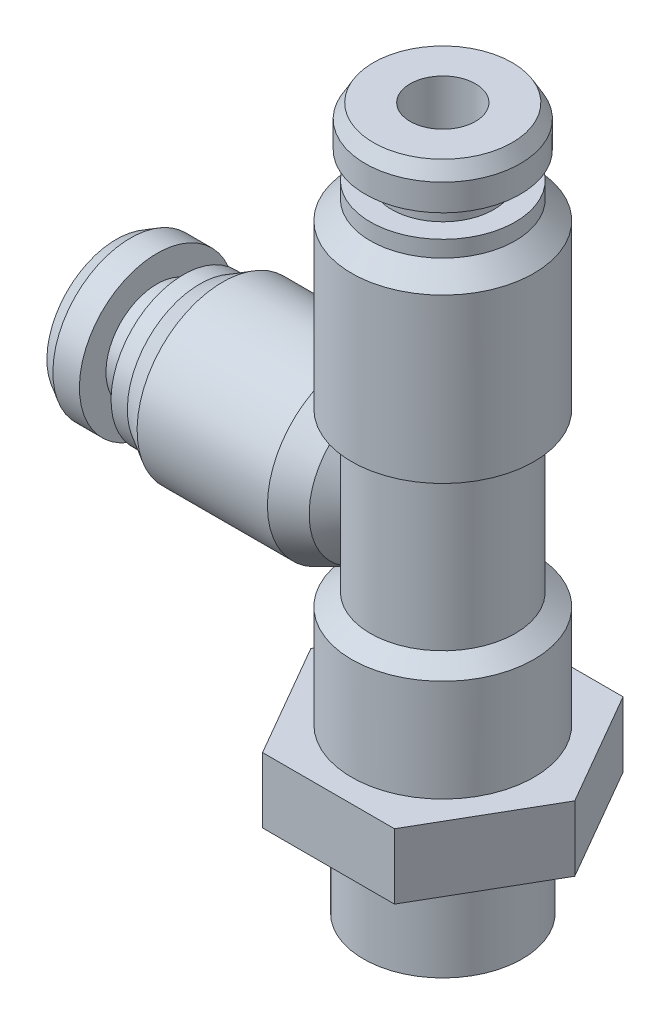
ISO-10303-21;
HEADER;
FILE_DESCRIPTION(('STEP AP214'),'2;1');
FILE_NAME('part.step','',(''),(''),'','','');
FILE_SCHEMA(('AUTOMOTIVE_DESIGN { 1 0 10303 214 1 1 1 1 }'));
ENDSEC;
DATA;
#1=APPLICATION_CONTEXT('core data for automotive mechanical design processes');
#2=APPLICATION_PROTOCOL_DEFINITION('international standard','automotive_design',2000,#1);
#3=PRODUCT_CONTEXT('',#1,'mechanical');
#4=PRODUCT('Part','Part','',(#3));
#5=PRODUCT_RELATED_PRODUCT_CATEGORY('part','',(#4));
#6=PRODUCT_DEFINITION_FORMATION('','',#4);
#7=PRODUCT_DEFINITION_CONTEXT('part definition',#1,'design');
#8=PRODUCT_DEFINITION('design','',#6,#7);
#9=PRODUCT_DEFINITION_SHAPE('','',#8);
#10=(LENGTH_UNIT() NAMED_UNIT(*) SI_UNIT(.MILLI.,.METRE.));
#11=(NAMED_UNIT(*) PLANE_ANGLE_UNIT() SI_UNIT($,.RADIAN.));
#12=(NAMED_UNIT(*) SI_UNIT($,.STERADIAN.) SOLID_ANGLE_UNIT());
#13=UNCERTAINTY_MEASURE_WITH_UNIT(LENGTH_MEASURE(1.E-05),#10,'distance_accuracy_value','');
#14=(GEOMETRIC_REPRESENTATION_CONTEXT(3) GLOBAL_UNCERTAINTY_ASSIGNED_CONTEXT((#13)) GLOBAL_UNIT_ASSIGNED_CONTEXT((#10,
#11,#12)) REPRESENTATION_CONTEXT('',''));
#15=CARTESIAN_POINT('',(0.,0.,0.));
#16=DIRECTION('',(0.,0.,1.));
#17=DIRECTION('',(1.,0.,0.));
#18=AXIS2_PLACEMENT_3D('',#15,#16,#17);
#19=CARTESIAN_POINT('',(9.,-11.5,0.));
#20=DIRECTION('',(0.,1.,0.));
#21=DIRECTION('',(0.,0.,1.));
#22=AXIS2_PLACEMENT_3D('',#19,#20,#21);
#23=PLANE('',#22);
#24=CARTESIAN_POINT('',(0.,-11.5,0.));
#25=DIRECTION('',(0.,-1.,0.));
#26=DIRECTION('',(0.,0.,-1.));
#27=AXIS2_PLACEMENT_3D('',#24,#25,#26);
#28=CIRCLE('',#27,5.58654851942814);
#29=CARTESIAN_POINT('',(0.,-11.5,-5.58654851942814));
#30=VERTEX_POINT('',#29);
#31=EDGE_CURVE('E193',#30,#30,#28,.T.);
#32=ORIENTED_EDGE('',*,*,#31,.T.);
#33=EDGE_LOOP('',(#32));
#34=FACE_BOUND('',#33,.T.);
#35=DIRECTION('',(0.5,0.,0.866025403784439));
#36=VECTOR('',#35,1.);
#37=CARTESIAN_POINT('',(4.04145188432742,-11.5,-7.));
#38=LINE('',#37,#36);
#39=CARTESIAN_POINT('',(4.04145188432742,-11.5,-7.));
#40=VERTEX_POINT('',#39);
#41=CARTESIAN_POINT('',(8.0829037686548,-11.5,0.));
#42=VERTEX_POINT('',#41);
#43=EDGE_CURVE('E169',#40,#42,#38,.T.);
#44=ORIENTED_EDGE('',*,*,#43,.F.);
#45=DIRECTION('',(1.,0.,0.));
#46=VECTOR('',#45,1.);
#47=CARTESIAN_POINT('',(-4.04145188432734,-11.5,-7.));
#48=LINE('',#47,#46);
#49=CARTESIAN_POINT('',(-4.04145188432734,-11.5,-7.));
#50=VERTEX_POINT('',#49);
#51=EDGE_CURVE('E41',#50,#40,#48,.T.);
#52=ORIENTED_EDGE('',*,*,#51,.F.);
#53=DIRECTION('',(0.5,0.,-0.866025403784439));
#54=VECTOR('',#53,1.);
#55=CARTESIAN_POINT('',(-8.08290376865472,-11.5,0.));
#56=LINE('',#55,#54);
#57=CARTESIAN_POINT('',(-8.08290376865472,-11.5,0.));
#58=VERTEX_POINT('',#57);
#59=EDGE_CURVE('E164',#58,#50,#56,.T.);
#60=ORIENTED_EDGE('',*,*,#59,.F.);
#61=DIRECTION('',(-0.5,0.,-0.866025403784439));
#62=VECTOR('',#61,1.);
#63=CARTESIAN_POINT('',(-4.04145188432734,-11.5,7.));
#64=LINE('',#63,#62);
#65=CARTESIAN_POINT('',(-4.04145188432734,-11.5,7.));
#66=VERTEX_POINT('',#65);
#67=EDGE_CURVE('E172',#66,#58,#64,.T.);
#68=ORIENTED_EDGE('',*,*,#67,.F.);
#69=DIRECTION('',(-1.,0.,0.));
#70=VECTOR('',#69,1.);
#71=CARTESIAN_POINT('',(4.04145188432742,-11.5,7.));
#72=LINE('',#71,#70);
#73=CARTESIAN_POINT('',(4.04145188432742,-11.5,7.));
#74=VERTEX_POINT('',#73);
#75=EDGE_CURVE('E176',#74,#66,#72,.T.);
#76=ORIENTED_EDGE('',*,*,#75,.F.);
#77=DIRECTION('',(-0.5,0.,0.866025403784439));
#78=VECTOR('',#77,1.);
#79=CARTESIAN_POINT('',(8.0829037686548,-11.5,0.));
#80=LINE('',#79,#78);
#81=EDGE_CURVE('E179',#42,#74,#80,.T.);
#82=ORIENTED_EDGE('',*,*,#81,.F.);
#83=EDGE_LOOP('',(#44,#52,#60,#68,#76,#82));
#84=FACE_BOUND('',#83,.T.);
#85=ADVANCED_FACE('F15',(#34,#84),#23,.T.);
#86=CARTESIAN_POINT('',(0.,0.,0.));
#87=DIRECTION('',(-1.,0.,0.));
#88=DIRECTION('',(0.,-1.,0.));
#89=AXIS2_PLACEMENT_3D('',#86,#87,#88);
#90=CONICAL_SURFACE('',#89,0.,0.869171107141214);
#91=CARTESIAN_POINT('',(-3.75,0.,0.));
#92=DIRECTION('',(-1.,0.,0.));
#93=DIRECTION('',(0.,-1.,0.));
#94=AXIS2_PLACEMENT_3D('',#91,#92,#93);
#95=CIRCLE('',#94,4.4375);
#96=CARTESIAN_POINT('',(-3.74999999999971,3.74999999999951,-2.37253161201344));
#97=VERTEX_POINT('',#96);
#98=CARTESIAN_POINT('',(-3.75,-3.75,-2.37253161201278));
#99=VERTEX_POINT('',#98);
#100=EDGE_CURVE('E247',#97,#99,#95,.T.);
#101=ORIENTED_EDGE('',*,*,#100,.F.);
#102=CARTESIAN_POINT('',(-4.1252,4.59943266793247,-1.63527710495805));
#103=CARTESIAN_POINT('',(-4.09113424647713,4.52609496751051,-1.72114160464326));
#104=CARTESIAN_POINT('',(-4.05564362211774,4.44884759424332,-1.80291606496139));
#105=CARTESIAN_POINT('',(-3.98278654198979,4.28794740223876,-1.95863485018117));
#106=CARTESIAN_POINT('',(-3.94542405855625,4.20430796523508,-2.03259480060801));
#107=CARTESIAN_POINT('',(-3.86982538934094,4.03212564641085,-2.17305632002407));
#108=CARTESIAN_POINT('',(-3.83159401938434,3.94360711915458,-2.23959066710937));
#109=CARTESIAN_POINT('',(-3.75477674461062,3.76207995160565,-2.3661235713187));
#110=CARTESIAN_POINT('',(-3.71619060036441,3.66906806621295,-2.4261172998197));
#111=CARTESIAN_POINT('',(-3.61958577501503,3.43047062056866,-2.56920658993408));
#112=CARTESIAN_POINT('',(-3.56176549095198,3.28241942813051,-2.64834084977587));
#113=CARTESIAN_POINT('',(-3.44890717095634,2.9791221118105,-2.79372620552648));
#114=CARTESIAN_POINT('',(-3.39386978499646,2.82387432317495,-2.85997430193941));
#115=CARTESIAN_POINT('',(-3.28838687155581,2.50650169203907,-2.98066530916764));
#116=CARTESIAN_POINT('',(-3.23796223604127,2.34435000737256,-3.0350559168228));
#117=CARTESIAN_POINT('',(-3.14413625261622,2.01460903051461,-3.13215122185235));
#118=CARTESIAN_POINT('',(-3.10073438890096,1.84702013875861,-3.17485677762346));
#119=CARTESIAN_POINT('',(-3.02271031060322,1.50507978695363,-3.24924242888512));
#120=CARTESIAN_POINT('',(-2.98820416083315,1.33067010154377,-3.28077860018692));
#121=CARTESIAN_POINT('',(-2.93093158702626,0.978206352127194,-3.33204659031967));
#122=CARTESIAN_POINT('',(-2.90816389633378,0.800152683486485,-3.35177968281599));
#123=CARTESIAN_POINT('',(-2.87619071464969,0.442702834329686,-3.37925787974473));
#124=CARTESIAN_POINT('',(-2.86692455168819,0.263316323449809,-3.3870566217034));
#125=CARTESIAN_POINT('',(-2.86255286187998,-0.0957423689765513,-3.39075375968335));
#126=CARTESIAN_POINT('',(-2.86744556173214,-0.275414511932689,-3.38665364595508));
#127=CARTESIAN_POINT('',(-2.88931639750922,-0.608278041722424,-3.36799863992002));
#128=CARTESIAN_POINT('',(-2.90452029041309,-0.761679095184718,-3.35497603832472));
#129=CARTESIAN_POINT('',(-2.94418951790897,-1.06633962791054,-3.32021823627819));
#130=CARTESIAN_POINT('',(-2.9686590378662,-1.21759810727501,-3.29847909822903));
#131=CARTESIAN_POINT('',(-3.02569953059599,-1.51771904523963,-3.24623558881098));
#132=CARTESIAN_POINT('',(-3.05830510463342,-1.66656830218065,-3.21569369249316));
#133=CARTESIAN_POINT('',(-3.13008311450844,-1.96052003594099,-3.14586871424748));
#134=CARTESIAN_POINT('',(-3.16925357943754,-2.10562362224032,-3.10658825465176));
#135=CARTESIAN_POINT('',(-3.25555788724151,-2.40143801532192,-3.01611049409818));
#136=CARTESIAN_POINT('',(-3.30305386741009,-2.55184960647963,-2.96428008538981));
#137=CARTESIAN_POINT('',(-3.40214615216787,-2.84723932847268,-2.85000557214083));
#138=CARTESIAN_POINT('',(-3.45374344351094,-2.99221613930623,-2.78755890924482));
#139=CARTESIAN_POINT('',(-3.55908772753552,-3.27512452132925,-2.65172635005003));
#140=CARTESIAN_POINT('',(-3.61282197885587,-3.41308915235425,-2.57839974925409));
#141=CARTESIAN_POINT('',(-3.72100105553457,-3.68150174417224,-2.41966634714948));
#142=CARTESIAN_POINT('',(-3.7754453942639,-3.81195455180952,-2.33426746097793));
#143=CARTESIAN_POINT('',(-3.88085161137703,-4.05798816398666,-2.15424724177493));
#144=CARTESIAN_POINT('',(-3.93185976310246,-4.17397445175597,-2.06021607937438));
#145=CARTESIAN_POINT('',(-4.00629364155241,-4.33999750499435,-1.90897519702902));
#146=CARTESIAN_POINT('',(-4.03080470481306,-4.39411103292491,-1.85674969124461));
#147=CARTESIAN_POINT('',(-4.07882958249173,-4.49922620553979,-1.74872624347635));
#148=CARTESIAN_POINT('',(-4.10234244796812,-4.5502249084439,-1.69292502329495));
#149=CARTESIAN_POINT('',(-4.1252,-4.59943266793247,-1.63527710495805));
#150=B_SPLINE_CURVE_WITH_KNOTS('',3,(#102,#103,#104,#105,#106,#107,#108,#109,#110,#111,#112,
#113,#114,#115,#116,#117,#118,#119,#120,#121,#122,#123,#124,#125,#126,#127,#128,#129,#130,#131,
#132,#133,#134,#135,#136,#137,#138,#139,#140,#141,#142,#143,#144,#145,#146,#147,#148,#149),
.UNSPECIFIED.,.F.,.F.,(4,2,2,2,2,2,2,2,2,2,2,2,2,2,2,2,2,2,2,2,2,2,2,4),(0.,0.353502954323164,
0.706285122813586,1.05744269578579,1.40885778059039,1.94076840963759,2.47280270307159,
3.00713832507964,3.54143468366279,4.08238469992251,4.62327633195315,5.16172977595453,
5.7001157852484,6.16367272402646,6.62743930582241,7.09321286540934,7.55884684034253,
8.05645646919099,8.55418618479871,9.04929666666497,9.54408402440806,10.0165408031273,
10.2537042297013,10.491088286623),.UNSPECIFIED.);
#151=EDGE_CURVE('E773',#97,#99,#150,.T.);
#152=ORIENTED_EDGE('',*,*,#151,.T.);
#153=EDGE_LOOP('',(#101,#152));
#154=FACE_BOUND('',#153,.T.);
#155=ADVANCED_FACE('F453',(#154),#90,.T.);
#156=CARTESIAN_POINT('',(-3.75,0.,0.));
#157=DIRECTION('',(-1.,0.,0.));
#158=DIRECTION('',(0.,-1.,0.));
#159=AXIS2_PLACEMENT_3D('',#156,#157,#158);
#160=CONICAL_SURFACE('',#159,4.4375,0.436332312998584);
#161=CARTESIAN_POINT('',(-5.49241187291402,0.,0.));
#162=DIRECTION('',(-1.,0.,0.));
#163=DIRECTION('',(0.,-1.,0.));
#164=AXIS2_PLACEMENT_3D('',#161,#162,#163);
#165=CIRCLE('',#164,5.25);
#166=CARTESIAN_POINT('',(-5.49241187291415,5.20562150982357,-0.68117890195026));
#167=VERTEX_POINT('',#166);
#168=CARTESIAN_POINT('',(-5.49241187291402,-5.21039954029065,-0.643612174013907));
#169=VERTEX_POINT('',#168);
#170=EDGE_CURVE('E243',#167,#169,#165,.T.);
#171=ORIENTED_EDGE('',*,*,#170,.F.);
#172=CARTESIAN_POINT('',(-5.49261187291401,5.20574264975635,-0.680971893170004));
#173=CARTESIAN_POINT('',(-5.45874576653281,5.18522977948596,-0.715980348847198));
#174=CARTESIAN_POINT('',(-5.42361555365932,5.16396496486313,-0.749223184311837));
#175=CARTESIAN_POINT('',(-5.35141027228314,5.12029083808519,-0.812575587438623));
#176=CARTESIAN_POINT('',(-5.31433844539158,5.09788343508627,-0.842690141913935));
#177=CARTESIAN_POINT('',(-5.20127084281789,5.02959803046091,-0.928822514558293));
#178=CARTESIAN_POINT('',(-5.12309118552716,4.98245577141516,-0.980952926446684));
#179=CARTESIAN_POINT('',(-4.96423875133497,4.88685314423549,-1.07652579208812));
#180=CARTESIAN_POINT('',(-4.88361166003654,4.83841791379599,-1.12007248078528));
#181=CARTESIAN_POINT('',(-4.71990031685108,4.7402870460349,-1.20088759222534));
#182=CARTESIAN_POINT('',(-4.63681357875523,4.69059014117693,-1.23814938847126));
#183=CARTESIAN_POINT('',(-4.49671573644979,4.60700476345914,-1.29591478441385));
#184=CARTESIAN_POINT('',(-4.44017237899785,4.5733260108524,-1.31788407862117));
#185=CARTESIAN_POINT('',(-4.32618988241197,4.50556123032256,-1.3597584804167));
#186=CARTESIAN_POINT('',(-4.26874787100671,4.47147405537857,-1.37965393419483));
#187=CARTESIAN_POINT('',(-4.21104112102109,4.43729999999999,-1.39857214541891));
#188=B_SPLINE_CURVE_WITH_KNOTS('',3,(#172,#173,#174,#175,#176,#177,#178,#179,#180,#181,#182,
#183,#184,#185,#186,#187),.UNSPECIFIED.,.F.,.F.,(4,2,2,2,2,2,2,4),(0.,0.158403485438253,
0.316550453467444,0.631339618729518,0.942032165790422,1.25305027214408,1.46116747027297,
1.6702138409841),.UNSPECIFIED.);
#189=CARTESIAN_POINT('',(-4.21137884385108,4.4375,-1.39846147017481));
#190=VERTEX_POINT('',#189);
#191=EDGE_CURVE('E307',#167,#190,#188,.T.);
#192=ORIENTED_EDGE('',*,*,#191,.T.);
#193=CARTESIAN_POINT('',(-4.33239539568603,4.61016648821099,-0.960081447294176));
#194=CARTESIAN_POINT('',(-4.31560296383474,4.58638559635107,-1.03586399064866));
#195=CARTESIAN_POINT('',(-4.29700717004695,4.55998276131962,-1.1103522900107));
#196=CARTESIAN_POINT('',(-4.2565922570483,4.50235918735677,-1.25640960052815));
#197=CARTESIAN_POINT('',(-4.23477790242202,4.47114556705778,-1.32798273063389));
#198=CARTESIAN_POINT('',(-4.15019468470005,4.34952316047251,-1.58275023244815));
#199=CARTESIAN_POINT('',(-4.07882331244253,4.24583260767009,-1.75693925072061));
#200=CARTESIAN_POINT('',(-3.9228168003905,4.01449535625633,-2.08225109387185));
#201=CARTESIAN_POINT('',(-3.83812917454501,3.88675344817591,-2.23327776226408));
#202=CARTESIAN_POINT('',(-3.64117226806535,3.58112775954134,-2.54449162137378));
#203=CARTESIAN_POINT('',(-3.52703697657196,3.39846722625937,-2.69880812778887));
#204=CARTESIAN_POINT('',(-3.35488634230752,3.10795588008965,-2.90589805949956));
#205=CARTESIAN_POINT('',(-3.2972681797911,3.00822276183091,-2.97093355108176));
#206=CARTESIAN_POINT('',(-3.18288135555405,2.80359594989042,-3.09316465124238));
#207=CARTESIAN_POINT('',(-3.12611247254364,2.69870363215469,-3.15036233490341));
#208=CARTESIAN_POINT('',(-3.00835918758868,2.47187446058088,-3.26321381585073));
#209=CARTESIAN_POINT('',(-2.94762691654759,2.34935374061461,-3.31795675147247));
#210=CARTESIAN_POINT('',(-2.83068452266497,2.09846377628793,-3.41826933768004));
#211=CARTESIAN_POINT('',(-2.77447575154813,1.97009280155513,-3.46383625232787));
#212=CARTESIAN_POINT('',(-2.66911560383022,1.70841219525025,-3.54565290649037));
#213=CARTESIAN_POINT('',(-2.61992971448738,1.57513107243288,-3.58194895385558));
#214=CARTESIAN_POINT('',(-2.5308431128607,1.30341675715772,-3.64544091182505));
#215=CARTESIAN_POINT('',(-2.49093573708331,1.16498734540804,-3.67264335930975));
#216=CARTESIAN_POINT('',(-2.4391049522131,0.950213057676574,-3.70710580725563));
#217=CARTESIAN_POINT('',(-2.4228664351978,0.87542253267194,-3.71771683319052));
#218=CARTESIAN_POINT('',(-2.39408158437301,0.724825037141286,-3.73631809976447));
#219=CARTESIAN_POINT('',(-2.38153412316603,0.649018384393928,-3.74430914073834));
#220=CARTESIAN_POINT('',(-2.36039210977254,0.496178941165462,-3.75767464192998));
#221=CARTESIAN_POINT('',(-2.35182051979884,0.41914162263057,-3.76303391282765));
#222=CARTESIAN_POINT('',(-2.33894609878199,0.264517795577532,-3.77104423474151));
#223=CARTESIAN_POINT('',(-2.33464629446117,0.18693093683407,-3.77369336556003));
#224=CARTESIAN_POINT('',(-2.33259357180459,0.10924978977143,-3.77497198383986));
#225=B_SPLINE_CURVE_WITH_KNOTS('',3,(#193,#194,#195,#196,#197,#198,#199,#200,#201,#202,#203,
#204,#205,#206,#207,#208,#209,#210,#211,#212,#213,#214,#215,#216,#217,#218,#219,#220,#221,#222,
#223,#224),.UNSPECIFIED.,.F.,.F.,(4,2,2,2,2,2,2,2,2,2,2,2,2,2,2,4),(0.,0.243357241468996,
0.486357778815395,1.12701127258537,1.77025630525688,2.56132278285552,2.95790416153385,
3.35438034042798,3.79582368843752,4.23739846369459,4.67672243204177,5.11572991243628,
5.34740820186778,5.57901565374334,5.81194456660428,6.04503840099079),.UNSPECIFIED.);
#226=EDGE_CURVE('E9',#190,#97,#225,.T.);
#227=ORIENTED_EDGE('',*,*,#226,.T.);
#228=ORIENTED_EDGE('',*,*,#100,.T.);
#229=CARTESIAN_POINT('',(-2.33286189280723,-0.118879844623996,-3.77480617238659));
#230=CARTESIAN_POINT('',(-2.3345548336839,-0.177345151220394,-3.77375719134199));
#231=CARTESIAN_POINT('',(-2.337507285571,-0.23574913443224,-3.77193396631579));
#232=CARTESIAN_POINT('',(-2.34585810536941,-0.352302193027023,-3.76674719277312));
#233=CARTESIAN_POINT('',(-2.35125599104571,-0.410451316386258,-3.76338394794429));
#234=CARTESIAN_POINT('',(-2.37097948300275,-0.5840844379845,-3.7510144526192));
#235=CARTESIAN_POINT('',(-2.388843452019,-0.699025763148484,-3.73972350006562));
#236=CARTESIAN_POINT('',(-2.4328054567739,-0.925637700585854,-3.7112715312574));
#237=CARTESIAN_POINT('',(-2.45884145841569,-1.03732624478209,-3.69415465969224));
#238=CARTESIAN_POINT('',(-2.51791579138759,-1.25782866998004,-3.65414529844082));
#239=CARTESIAN_POINT('',(-2.55095844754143,-1.36664072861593,-3.6312492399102));
#240=CARTESIAN_POINT('',(-2.63309670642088,-1.61204314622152,-3.5723164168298));
#241=CARTESIAN_POINT('',(-2.68406999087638,-1.74755195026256,-3.53439435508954));
#242=CARTESIAN_POINT('',(-2.79276445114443,-2.01277914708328,-3.44915127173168));
#243=CARTESIAN_POINT('',(-2.85048766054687,-2.14249577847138,-3.40182741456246));
#244=CARTESIAN_POINT('',(-2.97048742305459,-2.39617426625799,-3.29756614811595));
#245=CARTESIAN_POINT('',(-3.03277300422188,-2.52012387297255,-3.24060936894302));
#246=CARTESIAN_POINT('',(-3.15975651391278,-2.76166121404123,-3.11692184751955));
#247=CARTESIAN_POINT('',(-3.22445343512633,-2.87925155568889,-3.05019515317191));
#248=CARTESIAN_POINT('',(-3.3672256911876,-3.13005805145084,-2.89251056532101));
#249=CARTESIAN_POINT('',(-3.44544319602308,-3.26183324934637,-2.79936587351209));
#250=CARTESIAN_POINT('',(-3.59987200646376,-3.5144497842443,-2.59777769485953));
#251=CARTESIAN_POINT('',(-3.6760833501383,-3.63529132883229,-2.48933449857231));
#252=CARTESIAN_POINT('',(-3.83939313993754,-3.88872611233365,-2.23127292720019));
#253=CARTESIAN_POINT('',(-3.9253012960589,-4.01824509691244,-2.07781671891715));
#254=CARTESIAN_POINT('',(-4.08327458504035,-4.25236503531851,-1.74688443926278));
#255=CARTESIAN_POINT('',(-4.15538659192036,-4.35705066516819,-1.56949332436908));
#256=CARTESIAN_POINT('',(-4.23973583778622,-4.47824798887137,-1.31201746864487));
#257=CARTESIAN_POINT('',(-4.26101917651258,-4.50868367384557,-1.24125481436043));
#258=CARTESIAN_POINT('',(-4.30043096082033,-4.56484912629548,-1.09694888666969));
#259=CARTESIAN_POINT('',(-4.31855608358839,-4.5905739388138,-1.02340278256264));
#260=CARTESIAN_POINT('',(-4.33492123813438,-4.61374268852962,-0.948611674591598));
#261=B_SPLINE_CURVE_WITH_KNOTS('',3,(#229,#230,#231,#232,#233,#234,#235,#236,#237,#238,#239,
#240,#241,#242,#243,#244,#245,#246,#247,#248,#249,#250,#251,#252,#253,#254,#255,#256,#257,#258,
#259,#260),.UNSPECIFIED.,.F.,.F.,(4,2,2,2,2,2,2,2,2,2,2,2,2,2,2,4),(0.,0.175458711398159,
0.350882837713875,0.700919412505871,1.04836061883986,1.39601690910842,1.8443572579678,
2.29283303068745,2.74222156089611,3.1914244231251,3.72846820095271,4.26550178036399,
4.91819726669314,5.56863414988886,5.80817207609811,6.04796052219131),.UNSPECIFIED.);
#262=CARTESIAN_POINT('',(-4.21689393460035,-4.4454275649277,-1.38174230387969));
#263=VERTEX_POINT('',#262);
#264=EDGE_CURVE('E325',#99,#263,#261,.T.);
#265=ORIENTED_EDGE('',*,*,#264,.T.);
#266=CARTESIAN_POINT('',(-4.21655631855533,-4.44522756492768,-1.38185534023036));
#267=CARTESIAN_POINT('',(-4.29945585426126,-4.49433655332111,-1.3540475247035));
#268=CARTESIAN_POINT('',(-4.38183637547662,-4.54328144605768,-1.32422177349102));
#269=CARTESIAN_POINT('',(-4.54534989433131,-4.64067580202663,-1.25961651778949));
#270=CARTESIAN_POINT('',(-4.62647762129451,-4.68912297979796,-1.22482031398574));
#271=CARTESIAN_POINT('',(-4.78493289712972,-4.78395524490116,-1.15036614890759));
#272=CARTESIAN_POINT('',(-4.86230479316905,-4.83036224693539,-1.11083224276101));
#273=CARTESIAN_POINT('',(-5.0141536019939,-4.92160852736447,-1.02518380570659));
#274=CARTESIAN_POINT('',(-5.08863437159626,-4.96644988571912,-0.979078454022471));
#275=CARTESIAN_POINT('',(-5.21992150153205,-5.04561681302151,-0.887935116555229));
#276=CARTESIAN_POINT('',(-5.27743482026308,-5.08034468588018,-0.844299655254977));
#277=CARTESIAN_POINT('',(-5.38855088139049,-5.14751262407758,-0.749698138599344));
#278=CARTESIAN_POINT('',(-5.44211519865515,-5.17993012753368,-0.698671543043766));
#279=CARTESIAN_POINT('',(-5.49261187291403,-5.21052069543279,-0.643392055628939));
#280=B_SPLINE_CURVE_WITH_KNOTS('',3,(#266,#267,#268,#269,#270,#271,#272,#273,#274,#275,#276,
#277,#278,#279),.UNSPECIFIED.,.F.,.F.,(4,2,2,2,2,2,4),(0.,0.300911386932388,0.602858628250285,
0.898150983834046,1.19303483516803,1.432960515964,1.67497598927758),.UNSPECIFIED.);
#281=EDGE_CURVE('E290',#263,#169,#280,.T.);
#282=ORIENTED_EDGE('',*,*,#281,.T.);
#283=EDGE_LOOP('',(#171,#192,#227,#228,#265,#282));
#284=FACE_BOUND('',#283,.T.);
#285=ADVANCED_FACE('F301',(#284),#160,.T.);
#286=CARTESIAN_POINT('',(-3.7499999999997,-3.74999999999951,2.37253161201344));
#287=VERTEX_POINT('',#286);
#288=CARTESIAN_POINT('',(-3.75,3.75,2.37253161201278));
#289=VERTEX_POINT('',#288);
#290=EDGE_CURVE('E248',#287,#289,#95,.T.);
#291=ORIENTED_EDGE('',*,*,#290,.F.);
#292=CARTESIAN_POINT('',(-4.1252,-4.59943266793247,1.63527710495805));
#293=CARTESIAN_POINT('',(-4.09113424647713,-4.52609496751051,1.72114160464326));
#294=CARTESIAN_POINT('',(-4.05564362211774,-4.44884759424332,1.80291606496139));
#295=CARTESIAN_POINT('',(-3.98278654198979,-4.28794740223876,1.95863485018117));
#296=CARTESIAN_POINT('',(-3.94542405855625,-4.20430796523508,2.03259480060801));
#297=CARTESIAN_POINT('',(-3.86982538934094,-4.03212564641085,2.17305632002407));
#298=CARTESIAN_POINT('',(-3.83159401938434,-3.94360711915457,2.23959066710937));
#299=CARTESIAN_POINT('',(-3.75477674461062,-3.76207995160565,2.3661235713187));
#300=CARTESIAN_POINT('',(-3.71619060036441,-3.66906806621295,2.4261172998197));
#301=CARTESIAN_POINT('',(-3.61958577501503,-3.43047062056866,2.56920658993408));
#302=CARTESIAN_POINT('',(-3.56176549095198,-3.2824194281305,2.64834084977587));
#303=CARTESIAN_POINT('',(-3.44890717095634,-2.9791221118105,2.79372620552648));
#304=CARTESIAN_POINT('',(-3.39386978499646,-2.82387432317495,2.85997430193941));
#305=CARTESIAN_POINT('',(-3.28838687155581,-2.50650169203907,2.98066530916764));
#306=CARTESIAN_POINT('',(-3.23796223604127,-2.34435000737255,3.0350559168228));
#307=CARTESIAN_POINT('',(-3.14413625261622,-2.0146090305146,3.13215122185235));
#308=CARTESIAN_POINT('',(-3.10073438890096,-1.84702013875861,3.17485677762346));
#309=CARTESIAN_POINT('',(-3.02271031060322,-1.50507978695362,3.24924242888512));
#310=CARTESIAN_POINT('',(-2.98820416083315,-1.33067010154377,3.28077860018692));
#311=CARTESIAN_POINT('',(-2.93093158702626,-0.97820635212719,3.33204659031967));
#312=CARTESIAN_POINT('',(-2.90816389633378,-0.80015268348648,3.35177968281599));
#313=CARTESIAN_POINT('',(-2.87619071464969,-0.442702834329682,3.37925787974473));
#314=CARTESIAN_POINT('',(-2.86692455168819,-0.263316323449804,3.3870566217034));
#315=CARTESIAN_POINT('',(-2.86255286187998,0.0957423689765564,3.39075375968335));
#316=CARTESIAN_POINT('',(-2.86744556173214,0.275414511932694,3.38665364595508));
#317=CARTESIAN_POINT('',(-2.88931639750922,0.608278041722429,3.36799863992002));
#318=CARTESIAN_POINT('',(-2.90452029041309,0.761679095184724,3.35497603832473));
#319=CARTESIAN_POINT('',(-2.94418951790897,1.06633962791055,3.32021823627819));
#320=CARTESIAN_POINT('',(-2.9686590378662,1.21759810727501,3.29847909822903));
#321=CARTESIAN_POINT('',(-3.02569953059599,1.51771904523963,3.24623558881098));
#322=CARTESIAN_POINT('',(-3.05830510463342,1.66656830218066,3.21569369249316));
#323=CARTESIAN_POINT('',(-3.13008311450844,1.960520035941,3.14586871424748));
#324=CARTESIAN_POINT('',(-3.16925357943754,2.10562362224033,3.10658825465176));
#325=CARTESIAN_POINT('',(-3.25555788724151,2.40143801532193,3.01611049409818));
#326=CARTESIAN_POINT('',(-3.30305386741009,2.55184960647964,2.96428008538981));
#327=CARTESIAN_POINT('',(-3.40214615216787,2.84723932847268,2.85000557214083));
#328=CARTESIAN_POINT('',(-3.45374344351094,2.99221613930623,2.78755890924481));
#329=CARTESIAN_POINT('',(-3.55908772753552,3.27512452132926,2.65172635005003));
#330=CARTESIAN_POINT('',(-3.61282197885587,3.41308915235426,2.57839974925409));
#331=CARTESIAN_POINT('',(-3.72100105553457,3.68150174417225,2.41966634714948));
#332=CARTESIAN_POINT('',(-3.7754453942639,3.81195455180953,2.33426746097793));
#333=CARTESIAN_POINT('',(-3.88085161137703,4.05798816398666,2.15424724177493));
#334=CARTESIAN_POINT('',(-3.93185976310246,4.17397445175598,2.06021607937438));
#335=CARTESIAN_POINT('',(-4.00629364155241,4.33999750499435,1.90897519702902));
#336=CARTESIAN_POINT('',(-4.03080470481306,4.39411103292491,1.85674969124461));
#337=CARTESIAN_POINT('',(-4.07882958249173,4.49922620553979,1.74872624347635));
#338=CARTESIAN_POINT('',(-4.10234244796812,4.55022490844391,1.69292502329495));
#339=CARTESIAN_POINT('',(-4.1252,4.59943266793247,1.63527710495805));
#340=B_SPLINE_CURVE_WITH_KNOTS('',3,(#292,#293,#294,#295,#296,#297,#298,#299,#300,#301,#302,
#303,#304,#305,#306,#307,#308,#309,#310,#311,#312,#313,#314,#315,#316,#317,#318,#319,#320,#321,
#322,#323,#324,#325,#326,#327,#328,#329,#330,#331,#332,#333,#334,#335,#336,#337,#338,#339),
.UNSPECIFIED.,.F.,.F.,(4,2,2,2,2,2,2,2,2,2,2,2,2,2,2,2,2,2,2,2,2,2,2,4),(0.,0.353502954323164,
0.706285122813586,1.05744269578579,1.40885778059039,1.94076840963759,2.4728027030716,
3.00713832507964,3.54143468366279,4.08238469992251,4.62327633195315,5.16172977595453,
5.7001157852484,6.16367272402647,6.62743930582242,7.09321286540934,7.55884684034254,
8.05645646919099,8.55418618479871,9.04929666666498,9.54408402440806,10.0165408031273,
10.2537042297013,10.491088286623),.UNSPECIFIED.);
#341=EDGE_CURVE('E222',#287,#289,#340,.T.);
#342=ORIENTED_EDGE('',*,*,#341,.T.);
#343=EDGE_LOOP('',(#291,#342));
#344=FACE_BOUND('',#343,.T.);
#345=ADVANCED_FACE('F17',(#344),#90,.T.);
#346=CARTESIAN_POINT('',(-2.3325935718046,0.109249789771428,3.77497198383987));
#347=CARTESIAN_POINT('',(-2.33414891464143,0.167708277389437,3.7740081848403));
#348=CARTESIAN_POINT('',(-2.33696406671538,0.226109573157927,3.77227034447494));
#349=CARTESIAN_POINT('',(-2.3450430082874,0.342665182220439,3.76725449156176));
#350=CARTESIAN_POINT('',(-2.35030632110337,0.400819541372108,3.76397677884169));
#351=CARTESIAN_POINT('',(-2.36963388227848,0.574479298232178,3.75186338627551));
#352=CARTESIAN_POINT('',(-2.38724362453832,0.689452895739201,3.74074290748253));
#353=CARTESIAN_POINT('',(-2.43072601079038,0.916131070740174,3.71263174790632));
#354=CARTESIAN_POINT('',(-2.45653496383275,1.02785382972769,3.6956862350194));
#355=CARTESIAN_POINT('',(-2.51518782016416,1.24843935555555,3.65602088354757));
#356=CARTESIAN_POINT('',(-2.54803605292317,1.3573003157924,3.63329748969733));
#357=CARTESIAN_POINT('',(-2.62971330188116,1.60266225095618,3.57480171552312));
#358=CARTESIAN_POINT('',(-2.68041996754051,1.73809117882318,3.53715599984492));
#359=CARTESIAN_POINT('',(-2.78861987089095,2.00318224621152,3.45249551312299));
#360=CARTESIAN_POINT('',(-2.84611515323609,2.13284263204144,3.40547791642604));
#361=CARTESIAN_POINT('',(-2.96570613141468,2.38644691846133,3.30185824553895));
#362=CARTESIAN_POINT('',(-3.02781144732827,2.51037793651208,3.24523579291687));
#363=CARTESIAN_POINT('',(-3.15447824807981,2.75190562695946,3.12225343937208));
#364=CARTESIAN_POINT('',(-3.21903872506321,2.86950485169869,3.05589750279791));
#365=CARTESIAN_POINT('',(-3.36260058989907,3.12219658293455,2.89793040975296));
#366=CARTESIAN_POINT('',(-3.44176800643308,3.2557277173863,2.80394608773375));
#367=CARTESIAN_POINT('',(-3.59807553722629,3.51160132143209,2.60033257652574));
#368=CARTESIAN_POINT('',(-3.67521594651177,3.63394542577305,2.49070567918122));
#369=CARTESIAN_POINT('',(-3.83806413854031,3.88666345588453,2.23337240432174));
#370=CARTESIAN_POINT('',(-3.92274815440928,4.01439426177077,2.08236965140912));
#371=CARTESIAN_POINT('',(-4.07878162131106,4.24577008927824,1.75705057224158));
#372=CARTESIAN_POINT('',(-4.15017449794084,4.3494938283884,1.58281347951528));
#373=CARTESIAN_POINT('',(-4.23478183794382,4.47115134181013,1.32796994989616));
#374=CARTESIAN_POINT('',(-4.25660040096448,4.50237089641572,1.25638234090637));
#375=CARTESIAN_POINT('',(-4.29701461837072,4.55999328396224,1.11032319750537));
#376=CARTESIAN_POINT('',(-4.31560675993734,4.58639086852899,1.03584862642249));
#377=CARTESIAN_POINT('',(-4.33239539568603,4.61016648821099,0.960081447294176));
#378=B_SPLINE_CURVE_WITH_KNOTS('',3,(#346,#347,#348,#349,#350,#351,#352,#353,#354,#355,#356,
#357,#358,#359,#360,#361,#362,#363,#364,#365,#366,#367,#368,#369,#370,#371,#372,#373,#374,#375,
#376,#377),.UNSPECIFIED.,.F.,.F.,(4,2,2,2,2,2,2,2,2,2,2,2,2,2,2,4),(0.,0.175422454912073,
0.350810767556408,0.700775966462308,1.04808652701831,1.3956113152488,1.84325304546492,
2.29102994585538,2.73976904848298,3.18832588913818,3.73176255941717,4.27511969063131,
4.91813849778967,5.55901803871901,5.80206543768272,6.04537582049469),.UNSPECIFIED.);
#379=CARTESIAN_POINT('',(-4.21137884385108,4.4375,1.39846147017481));
#380=VERTEX_POINT('',#379);
#381=EDGE_CURVE('E26',#289,#380,#378,.T.);
#382=ORIENTED_EDGE('',*,*,#381,.T.);
#383=CARTESIAN_POINT('',(-4.21104112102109,4.43729999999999,1.39857214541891));
#384=CARTESIAN_POINT('',(-4.29828567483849,4.48896667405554,1.36991956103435));
#385=CARTESIAN_POINT('',(-4.38498545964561,4.54047024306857,1.33909255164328));
#386=CARTESIAN_POINT('',(-4.55709650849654,4.6429838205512,1.27204651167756));
#387=CARTESIAN_POINT('',(-4.64250104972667,4.69399094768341,1.23580593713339));
#388=CARTESIAN_POINT('',(-4.80925245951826,4.79380956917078,1.15797131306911));
#389=CARTESIAN_POINT('',(-4.89064723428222,4.84264468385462,1.11651197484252));
#390=CARTESIAN_POINT('',(-5.05024177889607,4.93858208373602,1.02635574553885));
#391=CARTESIAN_POINT('',(-5.12844685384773,4.98568723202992,0.977671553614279));
#392=CARTESIAN_POINT('',(-5.25497657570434,5.06202352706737,0.88870452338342));
#393=CARTESIAN_POINT('',(-5.30461935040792,5.09200760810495,0.850979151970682));
#394=CARTESIAN_POINT('',(-5.40109764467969,5.15033576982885,0.77019279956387));
#395=CARTESIAN_POINT('',(-5.44791091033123,5.17866680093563,0.72709608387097));
#396=CARTESIAN_POINT('',(-5.49261187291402,5.20574264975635,0.680971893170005));
#397=B_SPLINE_CURVE_WITH_KNOTS('',3,(#383,#384,#385,#386,#387,#388,#389,#390,#391,#392,#393,
#394,#395,#396),.UNSPECIFIED.,.F.,.F.,(4,2,2,2,2,2,4),(0.,0.316165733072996,0.63362497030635,
0.944127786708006,1.25409115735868,1.4613990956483,1.67016828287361),.UNSPECIFIED.);
#398=CARTESIAN_POINT('',(-5.49241187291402,5.20562150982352,0.681178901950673));
#399=VERTEX_POINT('',#398);
#400=EDGE_CURVE('E313',#380,#399,#397,.T.);
#401=ORIENTED_EDGE('',*,*,#400,.T.);
#402=CARTESIAN_POINT('',(-5.49241187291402,-5.21039954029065,0.643612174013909));
#403=VERTEX_POINT('',#402);
#404=EDGE_CURVE('E244',#403,#399,#165,.T.);
#405=ORIENTED_EDGE('',*,*,#404,.F.);
#406=CARTESIAN_POINT('',(-5.49261187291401,-5.21052069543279,0.643392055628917));
#407=CARTESIAN_POINT('',(-5.4612944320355,-5.19154918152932,0.677817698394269));
#408=CARTESIAN_POINT('',(-5.42869609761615,-5.17181346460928,0.710557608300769));
#409=CARTESIAN_POINT('',(-5.36152402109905,-5.13117432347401,0.773028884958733));
#410=CARTESIAN_POINT('',(-5.32695378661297,-5.11027297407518,0.802765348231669));
#411=CARTESIAN_POINT('',(-5.2213561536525,-5.04647686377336,0.887886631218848));
#412=CARTESIAN_POINT('',(-5.14810841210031,-5.00228795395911,0.939529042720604));
#413=CARTESIAN_POINT('',(-4.9990605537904,-4.91253132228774,1.03435804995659));
#414=CARTESIAN_POINT('',(-4.92331017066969,-4.86699136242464,1.0776523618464));
#415=CARTESIAN_POINT('',(-4.76931214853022,-4.77459692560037,1.15819783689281));
#416=CARTESIAN_POINT('',(-4.69106161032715,-4.72774093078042,1.19544165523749));
#417=CARTESIAN_POINT('',(-4.54725113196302,-4.64182684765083,1.25851314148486));
#418=CARTESIAN_POINT('',(-4.48197524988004,-4.6029026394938,1.28518464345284));
#419=CARTESIAN_POINT('',(-4.35010873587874,-4.52443627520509,1.33564676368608));
#420=CARTESIAN_POINT('',(-4.28351265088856,-4.48489183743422,1.35941964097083));
#421=CARTESIAN_POINT('',(-4.21655631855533,-4.44522756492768,1.38185534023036));
#422=B_SPLINE_CURVE_WITH_KNOTS('',3,(#406,#407,#408,#409,#410,#411,#412,#413,#414,#415,#416,
#417,#418,#419,#420,#421),.UNSPECIFIED.,.F.,.F.,(4,2,2,2,2,2,2,4),(0.,0.150620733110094,
0.300981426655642,0.600152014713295,0.89515739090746,1.19051824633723,1.43209022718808,
1.67507351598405),.UNSPECIFIED.);
#423=CARTESIAN_POINT('',(-4.21689393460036,-4.4454275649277,1.38174230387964));
#424=VERTEX_POINT('',#423);
#425=EDGE_CURVE('E284',#403,#424,#422,.T.);
#426=ORIENTED_EDGE('',*,*,#425,.T.);
#427=CARTESIAN_POINT('',(-4.33492123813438,-4.61374268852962,0.948611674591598));
#428=CARTESIAN_POINT('',(-4.31855944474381,-4.59057815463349,1.02340711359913));
#429=CARTESIAN_POINT('',(-4.30042705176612,-4.56484329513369,1.09697289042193));
#430=CARTESIAN_POINT('',(-4.26100739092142,-4.50866713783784,1.24128828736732));
#431=CARTESIAN_POINT('',(-4.23972471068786,-4.47823268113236,1.31204181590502));
#432=CARTESIAN_POINT('',(-4.18620857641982,-4.4013363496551,1.47542236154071));
#433=CARTESIAN_POINT('',(-4.15278419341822,-4.35303964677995,1.56680013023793));
#434=CARTESIAN_POINT('',(-4.08165377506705,-4.24941183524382,1.74373704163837));
#435=CARTESIAN_POINT('',(-4.04394453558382,-4.19407545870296,1.82929175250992));
#436=CARTESIAN_POINT('',(-3.92543325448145,-4.01844380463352,2.07750775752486));
#437=CARTESIAN_POINT('',(-3.83942702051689,-3.88877972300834,2.23120004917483));
#438=CARTESIAN_POINT('',(-3.69546272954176,-3.66536488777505,2.45872299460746));
#439=CARTESIAN_POINT('',(-3.63979463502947,-3.57757560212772,2.54017126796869));
#440=CARTESIAN_POINT('',(-3.5269234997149,-3.3957622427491,2.69469035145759));
#441=CARTESIAN_POINT('',(-3.46972028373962,-3.30173745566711,2.76776020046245));
#442=CARTESIAN_POINT('',(-3.35489009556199,-3.10796769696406,2.90589102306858));
#443=CARTESIAN_POINT('',(-3.29726257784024,-3.0082134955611,2.97093851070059));
#444=CARTESIAN_POINT('',(-3.18287322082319,-2.80358064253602,3.09317437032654));
#445=CARTESIAN_POINT('',(-3.1261111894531,-2.69870315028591,3.1503645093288));
#446=CARTESIAN_POINT('',(-3.0083596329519,-2.47187310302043,3.26321233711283));
#447=CARTESIAN_POINT('',(-2.94762094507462,-2.3493331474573,3.31796030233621));
#448=CARTESIAN_POINT('',(-2.83069658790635,-2.0984974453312,3.41826056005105));
#449=CARTESIAN_POINT('',(-2.77451228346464,-1.97019999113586,3.46381010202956));
#450=CARTESIAN_POINT('',(-2.61666775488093,-1.57811596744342,3.58637649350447));
#451=CARTESIAN_POINT('',(-2.52484853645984,-1.30557196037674,3.65008511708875));
#452=CARTESIAN_POINT('',(-2.42157036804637,-0.87752359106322,3.7187695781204));
#453=CARTESIAN_POINT('',(-2.39267554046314,-0.728290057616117,3.73726412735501));
#454=CARTESIAN_POINT('',(-2.36107082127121,-0.501695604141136,3.75724636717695));
#455=CARTESIAN_POINT('',(-2.35248449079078,-0.425481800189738,3.76261804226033));
#456=CARTESIAN_POINT('',(-2.33948655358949,-0.272507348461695,3.77071008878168));
#457=CARTESIAN_POINT('',(-2.33507784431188,-0.195746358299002,3.77342862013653));
#458=CARTESIAN_POINT('',(-2.33286189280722,-0.118879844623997,3.77480617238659));
#459=B_SPLINE_CURVE_WITH_KNOTS('',3,(#427,#428,#429,#430,#431,#432,#433,#434,#435,#436,#437,
#438,#439,#440,#441,#442,#443,#444,#445,#446,#447,#448,#449,#450,#451,#452,#453,#454,#455,#456,
#457,#458),.UNSPECIFIED.,.F.,.F.,(4,2,2,2,2,2,2,2,2,2,2,2,2,2,2,4),(0.,0.239836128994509,
0.479326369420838,0.804653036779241,1.13022459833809,1.78316272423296,2.17901294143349,
2.57490852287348,2.97146080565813,3.36792376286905,3.80935938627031,4.25092681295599,
5.12827222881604,5.58659015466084,5.8170894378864,6.04774847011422),.UNSPECIFIED.);
#460=EDGE_CURVE('E320',#424,#287,#459,.T.);
#461=ORIENTED_EDGE('',*,*,#460,.T.);
#462=ORIENTED_EDGE('',*,*,#290,.T.);
#463=EDGE_LOOP('',(#382,#401,#405,#426,#461,#462));
#464=FACE_BOUND('',#463,.T.);
#465=ADVANCED_FACE('F297',(#464),#160,.T.);
#466=CARTESIAN_POINT('',(-20.,0.,0.));
#467=DIRECTION('',(-1.,0.,0.));
#468=DIRECTION('',(0.,-1.,0.));
#469=AXIS2_PLACEMENT_3D('',#466,#467,#468);
#470=CYLINDRICAL_SURFACE('',#469,5.25);
#471=ORIENTED_EDGE('',*,*,#404,.T.);
#472=CARTESIAN_POINT('',(-5.48279820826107,5.20159543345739,0.711269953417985));
#473=CARTESIAN_POINT('',(-5.49923374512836,5.20847607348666,0.660978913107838));
#474=CARTESIAN_POINT('',(-5.51405021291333,5.21469246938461,0.61005556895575));
#475=CARTESIAN_POINT('',(-5.54017289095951,5.22566866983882,0.507468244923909));
#476=CARTESIAN_POINT('',(-5.55149811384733,5.2304363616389,0.45580993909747));
#477=CARTESIAN_POINT('',(-5.57055339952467,5.23846574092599,0.351710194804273));
#478=CARTESIAN_POINT('',(-5.5782832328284,5.24172733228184,0.299268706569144));
#479=CARTESIAN_POINT('',(-5.59005731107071,5.24669846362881,0.193605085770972));
#480=CARTESIAN_POINT('',(-5.59408076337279,5.24839924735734,0.140380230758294));
#481=CARTESIAN_POINT('',(-5.59616218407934,5.24927812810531,0.0870582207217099));
#482=B_SPLINE_CURVE_WITH_KNOTS('',3,(#472,#473,#474,#475,#476,#477,#478,#479,#480,#481),
.UNSPECIFIED.,.F.,.F.,(4,2,2,2,4),(0.,0.160047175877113,0.31920670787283,0.478376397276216,
0.638433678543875),.UNSPECIFIED.);
#483=CARTESIAN_POINT('',(-5.57909919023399,5.2420724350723,0.288403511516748));
#484=VERTEX_POINT('',#483);
#485=EDGE_CURVE('E346',#399,#484,#482,.T.);
#486=ORIENTED_EDGE('',*,*,#485,.T.);
#487=CARTESIAN_POINT('',(-5.57909919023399,5.2420724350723,0.288403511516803));
#488=CARTESIAN_POINT('',(-5.58033998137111,5.24339301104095,0.26440141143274));
#489=CARTESIAN_POINT('',(-5.58142606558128,5.24454907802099,0.240382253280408));
#490=CARTESIAN_POINT('',(-5.58328779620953,5.24653093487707,0.192330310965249));
#491=CARTESIAN_POINT('',(-5.58406359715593,5.2473568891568,0.168297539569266));
#492=CARTESIAN_POINT('',(-5.58530476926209,5.24867836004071,0.120222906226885));
#493=CARTESIAN_POINT('',(-5.58577024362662,5.24917398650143,0.0961810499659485));
#494=CARTESIAN_POINT('',(-5.58639082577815,5.24983477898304,0.0480927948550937));
#495=CARTESIAN_POINT('',(-5.58654598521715,5.25,0.0240463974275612));
#496=CARTESIAN_POINT('',(-5.58654598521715,5.25,-0.0240463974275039));
#497=CARTESIAN_POINT('',(-5.58639082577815,5.24983477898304,-0.0480927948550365));
#498=CARTESIAN_POINT('',(-5.58577024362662,5.24917398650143,-0.0961810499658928));
#499=CARTESIAN_POINT('',(-5.58530476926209,5.24867836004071,-0.120222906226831));
#500=CARTESIAN_POINT('',(-5.58406359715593,5.2473568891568,-0.168297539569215));
#501=CARTESIAN_POINT('',(-5.58328779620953,5.24653093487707,-0.1923303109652));
#502=CARTESIAN_POINT('',(-5.58142606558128,5.244549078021,-0.240382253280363));
#503=CARTESIAN_POINT('',(-5.58033998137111,5.24339301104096,-0.264401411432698));
#504=CARTESIAN_POINT('',(-5.57909919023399,5.2420724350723,-0.288403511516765));
#505=B_SPLINE_CURVE_WITH_KNOTS('',3,(#487,#488,#489,#490,#491,#492,#493,#494,#495,#496,#497,
#498,#499,#500,#501,#502,#503,#504),.UNSPECIFIED.,.F.,.F.,(4,2,2,2,2,2,2,2,4),(0.,
0.0722101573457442,0.144384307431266,0.216534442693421,0.288672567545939,0.360810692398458,
0.432960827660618,0.505134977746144,0.577345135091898),.UNSPECIFIED.);
#506=CARTESIAN_POINT('',(-5.57909919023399,5.2420724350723,-0.288403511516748));
#507=VERTEX_POINT('',#506);
#508=EDGE_CURVE('E343',#484,#507,#505,.T.);
#509=ORIENTED_EDGE('',*,*,#508,.T.);
#510=CARTESIAN_POINT('',(-5.59616218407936,5.24927812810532,-0.0870582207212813));
#511=CARTESIAN_POINT('',(-5.59408076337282,5.24839924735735,-0.140380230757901));
#512=CARTESIAN_POINT('',(-5.59005731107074,5.24669846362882,-0.193605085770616));
#513=CARTESIAN_POINT('',(-5.57828323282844,5.24172733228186,-0.299268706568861));
#514=CARTESIAN_POINT('',(-5.57055339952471,5.238465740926,-0.351710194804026));
#515=CARTESIAN_POINT('',(-5.55149811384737,5.23043636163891,-0.455809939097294));
#516=CARTESIAN_POINT('',(-5.54017289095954,5.22566866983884,-0.507468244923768));
#517=CARTESIAN_POINT('',(-5.51405021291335,5.21469246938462,-0.610055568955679));
#518=CARTESIAN_POINT('',(-5.49923374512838,5.20847607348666,-0.660978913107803));
#519=CARTESIAN_POINT('',(-5.4827982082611,5.20159543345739,-0.711269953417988));
#520=B_SPLINE_CURVE_WITH_KNOTS('',3,(#510,#511,#512,#513,#514,#515,#516,#517,#518,#519),
.UNSPECIFIED.,.F.,.F.,(4,2,2,2,4),(0.,0.160057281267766,0.319226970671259,0.47838650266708,
0.638433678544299),.UNSPECIFIED.);
#521=EDGE_CURVE('E20',#507,#167,#520,.T.);
#522=ORIENTED_EDGE('',*,*,#521,.T.);
#523=ORIENTED_EDGE('',*,*,#170,.T.);
#524=CARTESIAN_POINT('',(-5.48279820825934,-5.20637295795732,-0.675411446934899));
#525=CARTESIAN_POINT('',(-5.50055485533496,-5.2138080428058,-0.618155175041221));
#526=CARTESIAN_POINT('',(-5.51619101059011,-5.22037038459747,-0.560110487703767));
#527=CARTESIAN_POINT('',(-5.54296727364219,-5.23162462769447,-0.442785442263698));
#528=CARTESIAN_POINT('',(-5.55410500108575,-5.23631553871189,-0.383504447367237));
#529=CARTESIAN_POINT('',(-5.57136900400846,-5.24359224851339,-0.265753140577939));
#530=CARTESIAN_POINT('',(-5.57762483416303,-5.24623245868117,-0.207305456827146));
#531=CARTESIAN_POINT('',(-5.58549612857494,-5.24955536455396,-0.09007975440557));
#532=CARTESIAN_POINT('',(-5.58711322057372,-5.25023874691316,-0.0313018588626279));
#533=CARTESIAN_POINT('',(-5.58502064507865,-5.24935426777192,0.136052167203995));
#534=CARTESIAN_POINT('',(-5.57563698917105,-5.2453884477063,0.244626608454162));
#535=CARTESIAN_POINT('',(-5.54985345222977,-5.23452544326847,0.406579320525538));
#536=CARTESIAN_POINT('',(-5.53908722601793,-5.22999271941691,0.461115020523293));
#537=CARTESIAN_POINT('',(-5.5137444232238,-5.21934339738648,0.569115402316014));
#538=CARTESIAN_POINT('',(-5.49916938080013,-5.21322743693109,0.622580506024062));
#539=CARTESIAN_POINT('',(-5.48279820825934,-5.20637295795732,0.675411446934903));
#540=B_SPLINE_CURVE_WITH_KNOTS('',3,(#524,#525,#526,#527,#528,#529,#530,#531,#532,#533,#534,
#535,#536,#537,#538,#539),.UNSPECIFIED.,.F.,.F.,(4,2,2,2,2,2,2,4),(0.,0.181193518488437,
0.362482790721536,0.5387799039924,0.715015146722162,1.04056766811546,1.20775266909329,
1.37487043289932),.UNSPECIFIED.);
#541=CARTESIAN_POINT('',(-5.58654851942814,-5.25,0.));
#542=VERTEX_POINT('',#541);
#543=EDGE_CURVE('E258',#169,#542,#540,.T.);
#544=ORIENTED_EDGE('',*,*,#543,.T.);
#545=EDGE_CURVE('E251',#542,#403,#540,.T.);
#546=ORIENTED_EDGE('',*,*,#545,.T.);
#547=EDGE_LOOP('',(#471,#486,#509,#522,#523,#544,#546));
#548=FACE_BOUND('',#547,.T.);
#549=CARTESIAN_POINT('',(-13.4766833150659,0.,0.));
#550=DIRECTION('',(-1.,0.,0.));
#551=DIRECTION('',(0.,-1.,0.));
#552=AXIS2_PLACEMENT_3D('',#549,#550,#551);
#553=CIRCLE('',#552,5.25);
#554=CARTESIAN_POINT('',(-13.4766833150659,-5.25,0.));
#555=VERTEX_POINT('',#554);
#556=EDGE_CURVE('E240',#555,#555,#553,.T.);
#557=ORIENTED_EDGE('',*,*,#556,.F.);
#558=EDGE_LOOP('',(#557));
#559=FACE_BOUND('',#558,.T.);
#560=ADVANCED_FACE('F265',(#548,#559),#470,.T.);
#561=CARTESIAN_POINT('',(-13.4766833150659,0.,0.));
#562=DIRECTION('',(1.,0.,0.));
#563=DIRECTION('',(0.,1.,0.));
#564=AXIS2_PLACEMENT_3D('',#561,#562,#563);
#565=CONICAL_SURFACE('',#564,5.25,0.523598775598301);
#566=CARTESIAN_POINT('',(-14.8839745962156,0.,0.));
#567=DIRECTION('',(-1.,0.,0.));
#568=DIRECTION('',(0.,-1.,0.));
#569=AXIS2_PLACEMENT_3D('',#566,#567,#568);
#570=CIRCLE('',#569,4.4375);
#571=CARTESIAN_POINT('',(-14.8839745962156,-4.4375,0.));
#572=VERTEX_POINT('',#571);
#573=EDGE_CURVE('E237',#572,#572,#570,.T.);
#574=ORIENTED_EDGE('',*,*,#573,.F.);
#575=EDGE_LOOP('',(#574));
#576=FACE_BOUND('',#575,.T.);
#577=ORIENTED_EDGE('',*,*,#556,.T.);
#578=EDGE_LOOP('',(#577));
#579=FACE_BOUND('',#578,.T.);
#580=ADVANCED_FACE('F442',(#576,#579),#565,.T.);
#581=CARTESIAN_POINT('',(-20.,0.,0.));
#582=DIRECTION('',(-1.,0.,0.));
#583=DIRECTION('',(0.,-1.,0.));
#584=AXIS2_PLACEMENT_3D('',#581,#582,#583);
#585=CYLINDRICAL_SURFACE('',#584,4.4375);
#586=CARTESIAN_POINT('',(-15.8839745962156,0.,0.));
#587=DIRECTION('',(-1.,0.,0.));
#588=DIRECTION('',(0.,-1.,0.));
#589=AXIS2_PLACEMENT_3D('',#586,#587,#588);
#590=CIRCLE('',#589,4.4375);
#591=CARTESIAN_POINT('',(-15.8839745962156,-4.4375,0.));
#592=VERTEX_POINT('',#591);
#593=EDGE_CURVE('E234',#592,#592,#590,.T.);
#594=ORIENTED_EDGE('',*,*,#593,.F.);
#595=EDGE_LOOP('',(#594));
#596=FACE_BOUND('',#595,.T.);
#597=ORIENTED_EDGE('',*,*,#573,.T.);
#598=EDGE_LOOP('',(#597));
#599=FACE_BOUND('',#598,.T.);
#600=ADVANCED_FACE('F439',(#596,#599),#585,.T.);
#601=CARTESIAN_POINT('',(-15.8839745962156,3.125,0.));
#602=DIRECTION('',(1.,0.,0.));
#603=DIRECTION('',(0.,1.,0.));
#604=AXIS2_PLACEMENT_3D('',#601,#602,#603);
#605=PLANE('',#604);
#606=CARTESIAN_POINT('',(-15.8839745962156,0.,0.));
#607=DIRECTION('',(-1.,0.,0.));
#608=DIRECTION('',(0.,-1.,0.));
#609=AXIS2_PLACEMENT_3D('',#606,#607,#608);
#610=CIRCLE('',#609,3.125);
#611=CARTESIAN_POINT('',(-15.8839745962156,-3.125,0.));
#612=VERTEX_POINT('',#611);
#613=EDGE_CURVE('E231',#612,#612,#610,.T.);
#614=ORIENTED_EDGE('',*,*,#613,.F.);
#615=EDGE_LOOP('',(#614));
#616=FACE_BOUND('',#615,.T.);
#617=ORIENTED_EDGE('',*,*,#593,.T.);
#618=EDGE_LOOP('',(#617));
#619=FACE_BOUND('',#618,.T.);
#620=ADVANCED_FACE('F435',(#616,#619),#605,.F.);
#621=CARTESIAN_POINT('',(-20.,0.,0.));
#622=DIRECTION('',(-1.,0.,0.));
#623=DIRECTION('',(0.,-1.,0.));
#624=AXIS2_PLACEMENT_3D('',#621,#622,#623);
#625=CYLINDRICAL_SURFACE('',#624,3.125);
#626=CARTESIAN_POINT('',(-17.5089745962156,0.,0.));
#627=DIRECTION('',(-1.,0.,0.));
#628=DIRECTION('',(0.,-1.,0.));
#629=AXIS2_PLACEMENT_3D('',#626,#627,#628);
#630=CIRCLE('',#629,3.125);
#631=CARTESIAN_POINT('',(-17.5089745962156,-3.125,0.));
#632=VERTEX_POINT('',#631);
#633=EDGE_CURVE('E228',#632,#632,#630,.T.);
#634=ORIENTED_EDGE('',*,*,#633,.F.);
#635=EDGE_LOOP('',(#634));
#636=FACE_BOUND('',#635,.T.);
#637=ORIENTED_EDGE('',*,*,#613,.T.);
#638=EDGE_LOOP('',(#637));
#639=FACE_BOUND('',#638,.T.);
#640=ADVANCED_FACE('F431',(#636,#639),#625,.T.);
#641=CARTESIAN_POINT('',(-17.5089745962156,4.75,0.));
#642=DIRECTION('',(-1.,0.,0.));
#643=DIRECTION('',(0.,-1.,0.));
#644=AXIS2_PLACEMENT_3D('',#641,#642,#643);
#645=PLANE('',#644);
#646=CARTESIAN_POINT('',(-17.5089745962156,0.,0.));
#647=DIRECTION('',(-1.,0.,0.));
#648=DIRECTION('',(0.,-1.,0.));
#649=AXIS2_PLACEMENT_3D('',#646,#647,#648);
#650=CIRCLE('',#649,4.75);
#651=CARTESIAN_POINT('',(-17.5089745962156,-4.75,0.));
#652=VERTEX_POINT('',#651);
#653=EDGE_CURVE('E225',#652,#652,#650,.T.);
#654=ORIENTED_EDGE('',*,*,#653,.F.);
#655=EDGE_LOOP('',(#654));
#656=FACE_BOUND('',#655,.T.);
#657=ORIENTED_EDGE('',*,*,#633,.T.);
#658=EDGE_LOOP('',(#657));
#659=FACE_BOUND('',#658,.T.);
#660=ADVANCED_FACE('F427',(#656,#659),#645,.F.);
#661=CARTESIAN_POINT('',(-20.,0.,0.));
#662=DIRECTION('',(-1.,0.,0.));
#663=DIRECTION('',(0.,-1.,0.));
#664=AXIS2_PLACEMENT_3D('',#661,#662,#663);
#665=CYLINDRICAL_SURFACE('',#664,4.75);
#666=CARTESIAN_POINT('',(-19.1339745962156,0.,0.));
#667=DIRECTION('',(-1.,0.,0.));
#668=DIRECTION('',(0.,-1.,0.));
#669=AXIS2_PLACEMENT_3D('',#666,#667,#668);
#670=CIRCLE('',#669,4.75);
#671=CARTESIAN_POINT('',(-19.1339745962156,-4.75,0.));
#672=VERTEX_POINT('',#671);
#673=EDGE_CURVE('E221',#672,#672,#670,.T.);
#674=ORIENTED_EDGE('',*,*,#673,.F.);
#675=EDGE_LOOP('',(#674));
#676=FACE_BOUND('',#675,.T.);
#677=ORIENTED_EDGE('',*,*,#653,.T.);
#678=EDGE_LOOP('',(#677));
#679=FACE_BOUND('',#678,.T.);
#680=ADVANCED_FACE('F423',(#676,#679),#665,.T.);
#681=CARTESIAN_POINT('',(-19.1339745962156,0.,0.));
#682=DIRECTION('',(1.,0.,0.));
#683=DIRECTION('',(0.,1.,0.));
#684=AXIS2_PLACEMENT_3D('',#681,#682,#683);
#685=CONICAL_SURFACE('',#684,4.75,0.523598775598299);
#686=CARTESIAN_POINT('',(-20.,0.,0.));
#687=DIRECTION('',(-1.,0.,0.));
#688=DIRECTION('',(0.,-1.,0.));
#689=AXIS2_PLACEMENT_3D('',#686,#687,#688);
#690=CIRCLE('',#689,4.25);
#691=CARTESIAN_POINT('',(-20.,-4.25,0.));
#692=VERTEX_POINT('',#691);
#693=EDGE_CURVE('E218',#692,#692,#690,.T.);
#694=ORIENTED_EDGE('',*,*,#693,.F.);
#695=EDGE_LOOP('',(#694));
#696=FACE_BOUND('',#695,.T.);
#697=ORIENTED_EDGE('',*,*,#673,.T.);
#698=EDGE_LOOP('',(#697));
#699=FACE_BOUND('',#698,.T.);
#700=ADVANCED_FACE('F419',(#696,#699),#685,.T.);
#701=CARTESIAN_POINT('',(-20.,2.,0.));
#702=DIRECTION('',(1.,0.,0.));
#703=DIRECTION('',(0.,1.,0.));
#704=AXIS2_PLACEMENT_3D('',#701,#702,#703);
#705=PLANE('',#704);
#706=CARTESIAN_POINT('',(-20.,0.,0.));
#707=DIRECTION('',(-1.,0.,0.));
#708=DIRECTION('',(0.,-1.,0.));
#709=AXIS2_PLACEMENT_3D('',#706,#707,#708);
#710=CIRCLE('',#709,2.00000000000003);
#711=CARTESIAN_POINT('',(-20.,-2.00000000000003,0.));
#712=VERTEX_POINT('',#711);
#713=EDGE_CURVE('E137',#712,#712,#710,.T.);
#714=ORIENTED_EDGE('',*,*,#713,.F.);
#715=EDGE_LOOP('',(#714));
#716=FACE_BOUND('',#715,.T.);
#717=ORIENTED_EDGE('',*,*,#693,.T.);
#718=EDGE_LOOP('',(#717));
#719=FACE_BOUND('',#718,.T.);
#720=ADVANCED_FACE('F416',(#716,#719),#705,.F.);
#721=CARTESIAN_POINT('',(0.,0.,0.));
#722=DIRECTION('',(0.,-1.,0.));
#723=DIRECTION('',(0.,0.,-1.));
#724=AXIS2_PLACEMENT_3D('',#721,#722,#723);
#725=CYLINDRICAL_SURFACE('',#724,4.4375);
#726=ORIENTED_EDGE('',*,*,#460,.F.);
#727=CARTESIAN_POINT('',(0.,-4.4454275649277,0.));
#728=DIRECTION('',(0.,-1.,0.));
#729=DIRECTION('',(0.,0.,-1.));
#730=AXIS2_PLACEMENT_3D('',#727,#728,#729);
#731=CIRCLE('',#730,4.4375);
#732=EDGE_CURVE('E199',#263,#424,#731,.T.);
#733=ORIENTED_EDGE('',*,*,#732,.F.);
#734=ORIENTED_EDGE('',*,*,#264,.F.);
#735=ORIENTED_EDGE('',*,*,#151,.F.);
#736=ORIENTED_EDGE('',*,*,#226,.F.);
#737=CARTESIAN_POINT('',(0.,4.4375,0.));
#738=DIRECTION('',(0.,-1.,0.));
#739=DIRECTION('',(0.,0.,-1.));
#740=AXIS2_PLACEMENT_3D('',#737,#738,#739);
#741=CIRCLE('',#740,4.4375);
#742=EDGE_CURVE('E202',#190,#380,#741,.T.);
#743=ORIENTED_EDGE('',*,*,#742,.T.);
#744=ORIENTED_EDGE('',*,*,#381,.F.);
#745=ORIENTED_EDGE('',*,*,#341,.F.);
#746=EDGE_LOOP('',(#726,#733,#734,#735,#736,#743,#744,#745));
#747=FACE_BOUND('',#746,.T.);
#748=ADVANCED_FACE('F278',(#747),#725,.T.);
#749=CARTESIAN_POINT('',(0.,0.,0.));
#750=DIRECTION('',(0.,-1.,0.));
#751=DIRECTION('',(0.,0.,-1.));
#752=AXIS2_PLACEMENT_3D('',#749,#750,#751);
#753=CYLINDRICAL_SURFACE('',#752,5.58654851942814);
#754=CARTESIAN_POINT('',(0.,15.2349260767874,0.));
#755=DIRECTION('',(0.,-1.,0.));
#756=DIRECTION('',(0.,0.,-1.));
#757=AXIS2_PLACEMENT_3D('',#754,#755,#756);
#758=CIRCLE('',#757,5.58654851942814);
#759=CARTESIAN_POINT('',(0.,15.2349260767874,-5.58654851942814));
#760=VERTEX_POINT('',#759);
#761=EDGE_CURVE('E208',#760,#760,#758,.T.);
#762=ORIENTED_EDGE('',*,*,#761,.T.);
#763=EDGE_LOOP('',(#762));
#764=FACE_BOUND('',#763,.T.);
#765=ORIENTED_EDGE('',*,*,#508,.F.);
#766=CARTESIAN_POINT('',(0.,5.2420724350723,0.));
#767=DIRECTION('',(0.,-1.,0.));
#768=DIRECTION('',(0.,0.,-1.));
#769=AXIS2_PLACEMENT_3D('',#766,#767,#768);
#770=CIRCLE('',#769,5.58654851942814);
#771=EDGE_CURVE('E205',#507,#484,#770,.T.);
#772=ORIENTED_EDGE('',*,*,#771,.F.);
#773=EDGE_LOOP('',(#765,#772));
#774=FACE_BOUND('',#773,.T.);
#775=ADVANCED_FACE('F358',(#764,#774),#753,.T.);
#776=CARTESIAN_POINT('',(0.,4.4375,0.));
#777=DIRECTION('',(0.,1.,0.));
#778=DIRECTION('',(0.,0.,1.));
#779=AXIS2_PLACEMENT_3D('',#776,#777,#778);
#780=CONICAL_SURFACE('',#779,4.4375,0.959931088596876);
#781=ORIENTED_EDGE('',*,*,#400,.F.);
#782=ORIENTED_EDGE('',*,*,#742,.F.);
#783=ORIENTED_EDGE('',*,*,#191,.F.);
#784=ORIENTED_EDGE('',*,*,#521,.F.);
#785=ORIENTED_EDGE('',*,*,#771,.T.);
#786=ORIENTED_EDGE('',*,*,#485,.F.);
#787=EDGE_LOOP('',(#781,#782,#783,#784,#785,#786));
#788=FACE_BOUND('',#787,.T.);
#789=ADVANCED_FACE('F274',(#788),#780,.T.);
#790=CARTESIAN_POINT('',(0.,-5.25,0.));
#791=DIRECTION('',(0.,-1.,0.));
#792=DIRECTION('',(0.,0.,-1.));
#793=AXIS2_PLACEMENT_3D('',#790,#791,#792);
#794=CONICAL_SURFACE('',#793,5.58654851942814,0.959931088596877);
#795=ORIENTED_EDGE('',*,*,#281,.F.);
#796=ORIENTED_EDGE('',*,*,#732,.T.);
#797=ORIENTED_EDGE('',*,*,#425,.F.);
#798=ORIENTED_EDGE('',*,*,#545,.F.);
#799=CARTESIAN_POINT('',(0.,-5.25,0.));
#800=DIRECTION('',(0.,-1.,0.));
#801=DIRECTION('',(0.,0.,-1.));
#802=AXIS2_PLACEMENT_3D('',#799,#800,#801);
#803=CIRCLE('',#802,5.58654851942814);
#804=EDGE_CURVE('E196',#542,#542,#803,.T.);
#805=ORIENTED_EDGE('',*,*,#804,.F.);
#806=ORIENTED_EDGE('',*,*,#543,.F.);
#807=EDGE_LOOP('',(#795,#796,#797,#798,#805,#806));
#808=FACE_BOUND('',#807,.T.);
#809=ADVANCED_FACE('F268',(#808),#794,.T.);
#810=CARTESIAN_POINT('',(2.,4.5,0.));
#811=DIRECTION('',(0.,1.,0.));
#812=DIRECTION('',(0.,0.,1.));
#813=AXIS2_PLACEMENT_3D('',#810,#811,#812);
#814=PLANE('',#813);
#815=CARTESIAN_POINT('',(0.,4.5,0.));
#816=DIRECTION('',(0.,1.,0.));
#817=DIRECTION('',(0.,0.,1.));
#818=AXIS2_PLACEMENT_3D('',#815,#816,#817);
#819=CIRCLE('',#818,1.5);
#820=CARTESIAN_POINT('',(0.,4.5,1.5));
#821=VERTEX_POINT('',#820);
#822=EDGE_CURVE('E134',#821,#821,#819,.T.);
#823=ORIENTED_EDGE('',*,*,#822,.F.);
#824=EDGE_LOOP('',(#823));
#825=FACE_BOUND('',#824,.T.);
#826=CARTESIAN_POINT('',(0.,4.5,0.));
#827=DIRECTION('',(0.,-1.,0.));
#828=DIRECTION('',(0.,0.,-1.));
#829=AXIS2_PLACEMENT_3D('',#826,#827,#828);
#830=CIRCLE('',#829,2.);
#831=CARTESIAN_POINT('',(0.,4.5,-2.));
#832=VERTEX_POINT('',#831);
#833=EDGE_CURVE('E826',#832,#832,#830,.T.);
#834=ORIENTED_EDGE('',*,*,#833,.F.);
#835=EDGE_LOOP('',(#834));
#836=FACE_BOUND('',#835,.T.);
#837=ADVANCED_FACE('F273',(#825,#836),#814,.T.);
#838=CARTESIAN_POINT('',(0.,0.,0.));
#839=DIRECTION('',(0.,-1.,0.));
#840=DIRECTION('',(0.,0.,-1.));
#841=AXIS2_PLACEMENT_3D('',#838,#839,#840);
#842=CYLINDRICAL_SURFACE('',#841,2.);
#843=ORIENTED_EDGE('',*,*,#833,.T.);
#844=EDGE_LOOP('',(#843));
#845=FACE_BOUND('',#844,.T.);
#846=CARTESIAN_POINT('',(0.,21.5,0.));
#847=DIRECTION('',(0.,-1.,0.));
#848=DIRECTION('',(0.,0.,-1.));
#849=AXIS2_PLACEMENT_3D('',#846,#847,#848);
#850=CIRCLE('',#849,2.);
#851=CARTESIAN_POINT('',(0.,21.5,-2.));
#852=VERTEX_POINT('',#851);
#853=EDGE_CURVE('E828',#852,#852,#850,.T.);
#854=ORIENTED_EDGE('',*,*,#853,.F.);
#855=EDGE_LOOP('',(#854));
#856=FACE_BOUND('',#855,.T.);
#857=ADVANCED_FACE('F398',(#845,#856),#842,.F.);
#858=CARTESIAN_POINT('',(4.25,21.5,0.));
#859=DIRECTION('',(0.,1.,0.));
#860=DIRECTION('',(0.,0.,1.));
#861=AXIS2_PLACEMENT_3D('',#858,#859,#860);
#862=PLANE('',#861);
#863=ORIENTED_EDGE('',*,*,#853,.T.);
#864=EDGE_LOOP('',(#863));
#865=FACE_BOUND('',#864,.T.);
#866=CARTESIAN_POINT('',(0.,21.5,0.));
#867=DIRECTION('',(0.,-1.,0.));
#868=DIRECTION('',(0.,0.,-1.));
#869=AXIS2_PLACEMENT_3D('',#866,#867,#868);
#870=CIRCLE('',#869,4.25);
#871=CARTESIAN_POINT('',(0.,21.5,-4.25));
#872=VERTEX_POINT('',#871);
#873=EDGE_CURVE('E831',#872,#872,#870,.T.);
#874=ORIENTED_EDGE('',*,*,#873,.F.);
#875=EDGE_LOOP('',(#874));
#876=FACE_BOUND('',#875,.T.);
#877=ADVANCED_FACE('F394',(#865,#876),#862,.T.);
#878=CARTESIAN_POINT('',(0.,20.6339745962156,0.));
#879=DIRECTION('',(0.,-1.,0.));
#880=DIRECTION('',(0.,0.,-1.));
#881=AXIS2_PLACEMENT_3D('',#878,#879,#880);
#882=CONICAL_SURFACE('',#881,4.75,0.523598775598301);
#883=ORIENTED_EDGE('',*,*,#873,.T.);
#884=EDGE_LOOP('',(#883));
#885=FACE_BOUND('',#884,.T.);
#886=CARTESIAN_POINT('',(0.,20.6339745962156,0.));
#887=DIRECTION('',(0.,-1.,0.));
#888=DIRECTION('',(0.,0.,-1.));
#889=AXIS2_PLACEMENT_3D('',#886,#887,#888);
#890=CIRCLE('',#889,4.75);
#891=CARTESIAN_POINT('',(0.,20.6339745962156,-4.75));
#892=VERTEX_POINT('',#891);
#893=EDGE_CURVE('E836',#892,#892,#890,.T.);
#894=ORIENTED_EDGE('',*,*,#893,.F.);
#895=EDGE_LOOP('',(#894));
#896=FACE_BOUND('',#895,.T.);
#897=ADVANCED_FACE('F390',(#885,#896),#882,.T.);
#898=CARTESIAN_POINT('',(0.,0.,0.));
#899=DIRECTION('',(0.,-1.,0.));
#900=DIRECTION('',(0.,0.,-1.));
#901=AXIS2_PLACEMENT_3D('',#898,#899,#900);
#902=CYLINDRICAL_SURFACE('',#901,4.75);
#903=ORIENTED_EDGE('',*,*,#893,.T.);
#904=EDGE_LOOP('',(#903));
#905=FACE_BOUND('',#904,.T.);
#906=CARTESIAN_POINT('',(0.,19.0089745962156,0.));
#907=DIRECTION('',(0.,-1.,0.));
#908=DIRECTION('',(0.,0.,-1.));
#909=AXIS2_PLACEMENT_3D('',#906,#907,#908);
#910=CIRCLE('',#909,4.75);
#911=CARTESIAN_POINT('',(0.,19.0089745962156,-4.75));
#912=VERTEX_POINT('',#911);
#913=EDGE_CURVE('E839',#912,#912,#910,.T.);
#914=ORIENTED_EDGE('',*,*,#913,.F.);
#915=EDGE_LOOP('',(#914));
#916=FACE_BOUND('',#915,.T.);
#917=ADVANCED_FACE('F386',(#905,#916),#902,.T.);
#918=CARTESIAN_POINT('',(3.125,19.0089745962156,0.));
#919=DIRECTION('',(0.,-1.,0.));
#920=DIRECTION('',(0.,0.,-1.));
#921=AXIS2_PLACEMENT_3D('',#918,#919,#920);
#922=PLANE('',#921);
#923=ORIENTED_EDGE('',*,*,#913,.T.);
#924=EDGE_LOOP('',(#923));
#925=FACE_BOUND('',#924,.T.);
#926=CARTESIAN_POINT('',(0.,19.0089745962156,0.));
#927=DIRECTION('',(0.,-1.,0.));
#928=DIRECTION('',(0.,0.,-1.));
#929=AXIS2_PLACEMENT_3D('',#926,#927,#928);
#930=CIRCLE('',#929,3.125);
#931=CARTESIAN_POINT('',(0.,19.0089745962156,-3.125));
#932=VERTEX_POINT('',#931);
#933=EDGE_CURVE('E842',#932,#932,#930,.T.);
#934=ORIENTED_EDGE('',*,*,#933,.F.);
#935=EDGE_LOOP('',(#934));
#936=FACE_BOUND('',#935,.T.);
#937=ADVANCED_FACE('F382',(#925,#936),#922,.T.);
#938=CARTESIAN_POINT('',(0.,0.,0.));
#939=DIRECTION('',(0.,-1.,0.));
#940=DIRECTION('',(0.,0.,-1.));
#941=AXIS2_PLACEMENT_3D('',#938,#939,#940);
#942=CYLINDRICAL_SURFACE('',#941,3.125);
#943=ORIENTED_EDGE('',*,*,#933,.T.);
#944=EDGE_LOOP('',(#943));
#945=FACE_BOUND('',#944,.T.);
#946=CARTESIAN_POINT('',(0.,17.3839745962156,0.));
#947=DIRECTION('',(0.,-1.,0.));
#948=DIRECTION('',(0.,0.,-1.));
#949=AXIS2_PLACEMENT_3D('',#946,#947,#948);
#950=CIRCLE('',#949,3.125);
#951=CARTESIAN_POINT('',(0.,17.3839745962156,-3.125));
#952=VERTEX_POINT('',#951);
#953=EDGE_CURVE('E845',#952,#952,#950,.T.);
#954=ORIENTED_EDGE('',*,*,#953,.F.);
#955=EDGE_LOOP('',(#954));
#956=FACE_BOUND('',#955,.T.);
#957=ADVANCED_FACE('F378',(#945,#956),#942,.T.);
#958=CARTESIAN_POINT('',(4.4375,17.3839745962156,0.));
#959=DIRECTION('',(0.,1.,0.));
#960=DIRECTION('',(0.,0.,1.));
#961=AXIS2_PLACEMENT_3D('',#958,#959,#960);
#962=PLANE('',#961);
#963=ORIENTED_EDGE('',*,*,#953,.T.);
#964=EDGE_LOOP('',(#963));
#965=FACE_BOUND('',#964,.T.);
#966=CARTESIAN_POINT('',(0.,17.3839745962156,0.));
#967=DIRECTION('',(0.,-1.,0.));
#968=DIRECTION('',(0.,0.,-1.));
#969=AXIS2_PLACEMENT_3D('',#966,#967,#968);
#970=CIRCLE('',#969,4.4375);
#971=CARTESIAN_POINT('',(0.,17.3839745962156,-4.4375));
#972=VERTEX_POINT('',#971);
#973=EDGE_CURVE('E848',#972,#972,#970,.T.);
#974=ORIENTED_EDGE('',*,*,#973,.F.);
#975=EDGE_LOOP('',(#974));
#976=FACE_BOUND('',#975,.T.);
#977=ADVANCED_FACE('F374',(#965,#976),#962,.T.);
#978=CARTESIAN_POINT('',(0.,0.,0.));
#979=DIRECTION('',(0.,-1.,0.));
#980=DIRECTION('',(0.,0.,-1.));
#981=AXIS2_PLACEMENT_3D('',#978,#979,#980);
#982=CYLINDRICAL_SURFACE('',#981,4.4375);
#983=ORIENTED_EDGE('',*,*,#973,.T.);
#984=EDGE_LOOP('',(#983));
#985=FACE_BOUND('',#984,.T.);
#986=CARTESIAN_POINT('',(0.,16.3839745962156,0.));
#987=DIRECTION('',(0.,-1.,0.));
#988=DIRECTION('',(0.,0.,-1.));
#989=AXIS2_PLACEMENT_3D('',#986,#987,#988);
#990=CIRCLE('',#989,4.4375);
#991=CARTESIAN_POINT('',(0.,16.3839745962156,-4.4375));
#992=VERTEX_POINT('',#991);
#993=EDGE_CURVE('E850',#992,#992,#990,.T.);
#994=ORIENTED_EDGE('',*,*,#993,.F.);
#995=EDGE_LOOP('',(#994));
#996=FACE_BOUND('',#995,.T.);
#997=ADVANCED_FACE('F370',(#985,#996),#982,.T.);
#998=CARTESIAN_POINT('',(0.,15.2349260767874,0.));
#999=DIRECTION('',(0.,-1.,0.));
#1000=DIRECTION('',(0.,0.,-1.));
#1001=AXIS2_PLACEMENT_3D('',#998,#999,#1000);
#1002=CONICAL_SURFACE('',#1001,5.58654851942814,0.785398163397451);
#1003=ORIENTED_EDGE('',*,*,#993,.T.);
#1004=EDGE_LOOP('',(#1003));
#1005=FACE_BOUND('',#1004,.T.);
#1006=ORIENTED_EDGE('',*,*,#761,.F.);
#1007=EDGE_LOOP('',(#1006));
#1008=FACE_BOUND('',#1007,.T.);
#1009=ADVANCED_FACE('F367',(#1005,#1008),#1002,.T.);
#1010=CARTESIAN_POINT('',(0.,0.,0.));
#1011=DIRECTION('',(0.,-1.,0.));
#1012=DIRECTION('',(0.,0.,-1.));
#1013=AXIS2_PLACEMENT_3D('',#1010,#1011,#1012);
#1014=CYLINDRICAL_SURFACE('',#1013,5.58654851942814);
#1015=ORIENTED_EDGE('',*,*,#804,.T.);
#1016=EDGE_LOOP('',(#1015));
#1017=FACE_BOUND('',#1016,.T.);
#1018=ORIENTED_EDGE('',*,*,#31,.F.);
#1019=EDGE_LOOP('',(#1018));
#1020=FACE_BOUND('',#1019,.T.);
#1021=ADVANCED_FACE('F276',(#1017,#1020),#1014,.T.);
#1022=CARTESIAN_POINT('',(-4.04145188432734,22.9734172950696,-7.));
#1023=DIRECTION('',(0.,0.,-1.));
#1024=DIRECTION('',(-1.,0.,0.));
#1025=AXIS2_PLACEMENT_3D('',#1022,#1023,#1024);
#1026=PLANE('',#1025);
#1027=ORIENTED_EDGE('',*,*,#51,.T.);
#1028=DIRECTION('',(0.,-1.,0.));
#1029=VECTOR('',#1028,1.);
#1030=CARTESIAN_POINT('',(4.04145188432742,22.9734172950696,-7.));
#1031=LINE('',#1030,#1029);
#1032=CARTESIAN_POINT('',(4.04145188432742,-15.5,-7.));
#1033=VERTEX_POINT('',#1032);
#1034=EDGE_CURVE('E160',#40,#1033,#1031,.T.);
#1035=ORIENTED_EDGE('',*,*,#1034,.T.);
#1036=DIRECTION('',(1.,0.,0.));
#1037=VECTOR('',#1036,1.);
#1038=CARTESIAN_POINT('',(-4.04145188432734,-15.5,-7.));
#1039=LINE('',#1038,#1037);
#1040=CARTESIAN_POINT('',(-4.04145188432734,-15.5,-7.));
#1041=VERTEX_POINT('',#1040);
#1042=EDGE_CURVE('E165',#1041,#1033,#1039,.T.);
#1043=ORIENTED_EDGE('',*,*,#1042,.F.);
#1044=DIRECTION('',(0.,-1.,0.));
#1045=VECTOR('',#1044,1.);
#1046=CARTESIAN_POINT('',(-4.04145188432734,22.9734172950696,-7.));
#1047=LINE('',#1046,#1045);
#1048=EDGE_CURVE('E141',#50,#1041,#1047,.T.);
#1049=ORIENTED_EDGE('',*,*,#1048,.F.);
#1050=EDGE_LOOP('',(#1027,#1035,#1043,#1049));
#1051=FACE_BOUND('',#1050,.T.);
#1052=ADVANCED_FACE('F465',(#1051),#1026,.T.);
#1053=CARTESIAN_POINT('',(-8.08290376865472,22.9734172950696,0.));
#1054=DIRECTION('',(-0.866025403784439,0.,-0.5));
#1055=DIRECTION('',(-0.5,0.,0.866025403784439));
#1056=AXIS2_PLACEMENT_3D('',#1053,#1054,#1055);
#1057=PLANE('',#1056);
#1058=ORIENTED_EDGE('',*,*,#59,.T.);
#1059=ORIENTED_EDGE('',*,*,#1048,.T.);
#1060=DIRECTION('',(0.5,0.,-0.866025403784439));
#1061=VECTOR('',#1060,1.);
#1062=CARTESIAN_POINT('',(-8.08290376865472,-15.5,0.));
#1063=LINE('',#1062,#1061);
#1064=CARTESIAN_POINT('',(-8.08290376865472,-15.5,0.));
#1065=VERTEX_POINT('',#1064);
#1066=EDGE_CURVE('E144',#1065,#1041,#1063,.T.);
#1067=ORIENTED_EDGE('',*,*,#1066,.F.);
#1068=DIRECTION('',(0.,-1.,0.));
#1069=VECTOR('',#1068,1.);
#1070=CARTESIAN_POINT('',(-8.08290376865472,22.9734172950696,0.));
#1071=LINE('',#1070,#1069);
#1072=EDGE_CURVE('E148',#58,#1065,#1071,.T.);
#1073=ORIENTED_EDGE('',*,*,#1072,.F.);
#1074=EDGE_LOOP('',(#1058,#1059,#1067,#1073));
#1075=FACE_BOUND('',#1074,.T.);
#1076=ADVANCED_FACE('F468',(#1075),#1057,.T.);
#1077=CARTESIAN_POINT('',(-4.04145188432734,22.9734172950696,7.));
#1078=DIRECTION('',(-0.866025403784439,0.,0.5));
#1079=DIRECTION('',(0.5,0.,0.866025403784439));
#1080=AXIS2_PLACEMENT_3D('',#1077,#1078,#1079);
#1081=PLANE('',#1080);
#1082=ORIENTED_EDGE('',*,*,#67,.T.);
#1083=ORIENTED_EDGE('',*,*,#1072,.T.);
#1084=DIRECTION('',(-0.5,0.,-0.866025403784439));
#1085=VECTOR('',#1084,1.);
#1086=CARTESIAN_POINT('',(-4.04145188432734,-15.5,7.));
#1087=LINE('',#1086,#1085);
#1088=CARTESIAN_POINT('',(-4.04145188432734,-15.5,7.));
#1089=VERTEX_POINT('',#1088);
#1090=EDGE_CURVE('E149',#1089,#1065,#1087,.T.);
#1091=ORIENTED_EDGE('',*,*,#1090,.F.);
#1092=DIRECTION('',(0.,-1.,0.));
#1093=VECTOR('',#1092,1.);
#1094=CARTESIAN_POINT('',(-4.04145188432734,22.9734172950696,7.));
#1095=LINE('',#1094,#1093);
#1096=EDGE_CURVE('E147',#66,#1089,#1095,.T.);
#1097=ORIENTED_EDGE('',*,*,#1096,.F.);
#1098=EDGE_LOOP('',(#1082,#1083,#1091,#1097));
#1099=FACE_BOUND('',#1098,.T.);
#1100=ADVANCED_FACE('F471',(#1099),#1081,.T.);
#1101=CARTESIAN_POINT('',(4.04145188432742,22.9734172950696,7.));
#1102=DIRECTION('',(0.,0.,1.));
#1103=DIRECTION('',(1.,0.,0.));
#1104=AXIS2_PLACEMENT_3D('',#1101,#1102,#1103);
#1105=PLANE('',#1104);
#1106=ORIENTED_EDGE('',*,*,#75,.T.);
#1107=ORIENTED_EDGE('',*,*,#1096,.T.);
#1108=DIRECTION('',(-1.,0.,0.));
#1109=VECTOR('',#1108,1.);
#1110=CARTESIAN_POINT('',(4.04145188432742,-15.5,7.));
#1111=LINE('',#1110,#1109);
#1112=CARTESIAN_POINT('',(4.04145188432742,-15.5,7.));
#1113=VERTEX_POINT('',#1112);
#1114=EDGE_CURVE('E153',#1113,#1089,#1111,.T.);
#1115=ORIENTED_EDGE('',*,*,#1114,.F.);
#1116=DIRECTION('',(0.,-1.,0.));
#1117=VECTOR('',#1116,1.);
#1118=CARTESIAN_POINT('',(4.04145188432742,22.9734172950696,7.));
#1119=LINE('',#1118,#1117);
#1120=EDGE_CURVE('E152',#74,#1113,#1119,.T.);
#1121=ORIENTED_EDGE('',*,*,#1120,.F.);
#1122=EDGE_LOOP('',(#1106,#1107,#1115,#1121));
#1123=FACE_BOUND('',#1122,.T.);
#1124=ADVANCED_FACE('F475',(#1123),#1105,.T.);
#1125=CARTESIAN_POINT('',(8.0829037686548,22.9734172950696,0.));
#1126=DIRECTION('',(0.866025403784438,0.,0.5));
#1127=DIRECTION('',(0.5,0.,-0.866025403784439));
#1128=AXIS2_PLACEMENT_3D('',#1125,#1126,#1127);
#1129=PLANE('',#1128);
#1130=ORIENTED_EDGE('',*,*,#81,.T.);
#1131=ORIENTED_EDGE('',*,*,#1120,.T.);
#1132=DIRECTION('',(-0.5,0.,0.866025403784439));
#1133=VECTOR('',#1132,1.);
#1134=CARTESIAN_POINT('',(8.0829037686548,-15.5,0.));
#1135=LINE('',#1134,#1133);
#1136=CARTESIAN_POINT('',(8.0829037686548,-15.5,0.));
#1137=VERTEX_POINT('',#1136);
#1138=EDGE_CURVE('E157',#1137,#1113,#1135,.T.);
#1139=ORIENTED_EDGE('',*,*,#1138,.F.);
#1140=DIRECTION('',(0.,-1.,0.));
#1141=VECTOR('',#1140,1.);
#1142=CARTESIAN_POINT('',(8.0829037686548,22.9734172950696,0.));
#1143=LINE('',#1142,#1141);
#1144=EDGE_CURVE('E156',#42,#1137,#1143,.T.);
#1145=ORIENTED_EDGE('',*,*,#1144,.F.);
#1146=EDGE_LOOP('',(#1130,#1131,#1139,#1145));
#1147=FACE_BOUND('',#1146,.T.);
#1148=ADVANCED_FACE('F479',(#1147),#1129,.T.);
#1149=CARTESIAN_POINT('',(4.04145188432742,22.9734172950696,-7.));
#1150=DIRECTION('',(0.866025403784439,0.,-0.5));
#1151=DIRECTION('',(-0.5,0.,-0.866025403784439));
#1152=AXIS2_PLACEMENT_3D('',#1149,#1150,#1151);
#1153=PLANE('',#1152);
#1154=ORIENTED_EDGE('',*,*,#43,.T.);
#1155=ORIENTED_EDGE('',*,*,#1144,.T.);
#1156=DIRECTION('',(0.5,0.,0.866025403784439));
#1157=VECTOR('',#1156,1.);
#1158=CARTESIAN_POINT('',(4.04145188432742,-15.5,-7.));
#1159=LINE('',#1158,#1157);
#1160=EDGE_CURVE('E161',#1033,#1137,#1159,.T.);
#1161=ORIENTED_EDGE('',*,*,#1160,.F.);
#1162=ORIENTED_EDGE('',*,*,#1034,.F.);
#1163=EDGE_LOOP('',(#1154,#1155,#1161,#1162));
#1164=FACE_BOUND('',#1163,.T.);
#1165=ADVANCED_FACE('F410',(#1164),#1153,.T.);
#1166=CARTESIAN_POINT('',(0.,-21.5,0.));
#1167=DIRECTION('',(0.,-1.,0.));
#1168=DIRECTION('',(0.,0.,-1.));
#1169=AXIS2_PLACEMENT_3D('',#1166,#1167,#1168);
#1170=PLANE('',#1169);
#1171=CARTESIAN_POINT('',(0.,-21.5,0.));
#1172=DIRECTION('',(0.,-1.,0.));
#1173=DIRECTION('',(0.,0.,-1.));
#1174=AXIS2_PLACEMENT_3D('',#1171,#1172,#1173);
#1175=CIRCLE('',#1174,1.5);
#1176=CARTESIAN_POINT('',(0.,-21.5,-1.5));
#1177=VERTEX_POINT('',#1176);
#1178=EDGE_CURVE('E129',#1177,#1177,#1175,.T.);
#1179=ORIENTED_EDGE('',*,*,#1178,.F.);
#1180=EDGE_LOOP('',(#1179));
#1181=FACE_BOUND('',#1180,.T.);
#1182=CARTESIAN_POINT('',(0.,-21.5,0.));
#1183=DIRECTION('',(0.,-1.,0.));
#1184=DIRECTION('',(0.,0.,-1.));
#1185=AXIS2_PLACEMENT_3D('',#1182,#1183,#1184);
#1186=CIRCLE('',#1185,4.864);
#1187=CARTESIAN_POINT('',(0.,-21.5,-4.864));
#1188=VERTEX_POINT('',#1187);
#1189=EDGE_CURVE('E291',#1188,#1188,#1186,.T.);
#1190=ORIENTED_EDGE('',*,*,#1189,.T.);
#1191=EDGE_LOOP('',(#1190));
#1192=FACE_BOUND('',#1191,.T.);
#1193=ADVANCED_FACE('F406',(#1181,#1192),#1170,.T.);
#1194=CARTESIAN_POINT('',(0.,0.,0.));
#1195=DIRECTION('',(0.,-1.,0.));
#1196=DIRECTION('',(0.,0.,-1.));
#1197=AXIS2_PLACEMENT_3D('',#1194,#1195,#1196);
#1198=CYLINDRICAL_SURFACE('',#1197,4.864);
#1199=CARTESIAN_POINT('',(0.,-15.5,0.));
#1200=DIRECTION('',(0.,-1.,0.));
#1201=DIRECTION('',(0.,0.,-1.));
#1202=AXIS2_PLACEMENT_3D('',#1199,#1200,#1201);
#1203=CIRCLE('',#1202,4.864);
#1204=CARTESIAN_POINT('',(0.,-15.5,-4.864));
#1205=VERTEX_POINT('',#1204);
#1206=EDGE_CURVE('E175',#1205,#1205,#1203,.T.);
#1207=ORIENTED_EDGE('',*,*,#1206,.T.);
#1208=EDGE_LOOP('',(#1207));
#1209=FACE_BOUND('',#1208,.T.);
#1210=ORIENTED_EDGE('',*,*,#1189,.F.);
#1211=EDGE_LOOP('',(#1210));
#1212=FACE_BOUND('',#1211,.T.);
#1213=ADVANCED_FACE('F409',(#1209,#1212),#1198,.T.);
#1214=CARTESIAN_POINT('',(4.864,-15.5,0.));
#1215=DIRECTION('',(0.,-1.,0.));
#1216=DIRECTION('',(0.,0.,-1.));
#1217=AXIS2_PLACEMENT_3D('',#1214,#1215,#1216);
#1218=PLANE('',#1217);
#1219=ORIENTED_EDGE('',*,*,#1206,.F.);
#1220=EDGE_LOOP('',(#1219));
#1221=FACE_BOUND('',#1220,.T.);
#1222=ORIENTED_EDGE('',*,*,#1066,.T.);
#1223=ORIENTED_EDGE('',*,*,#1042,.T.);
#1224=ORIENTED_EDGE('',*,*,#1160,.T.);
#1225=ORIENTED_EDGE('',*,*,#1138,.T.);
#1226=ORIENTED_EDGE('',*,*,#1114,.T.);
#1227=ORIENTED_EDGE('',*,*,#1090,.T.);
#1228=EDGE_LOOP('',(#1222,#1223,#1224,#1225,#1226,#1227));
#1229=FACE_BOUND('',#1228,.T.);
#1230=ADVANCED_FACE('F414',(#1221,#1229),#1218,.T.);
#1231=CARTESIAN_POINT('',(-3.75,0.,0.));
#1232=DIRECTION('',(-1.,0.,0.));
#1233=DIRECTION('',(0.,-1.,0.));
#1234=AXIS2_PLACEMENT_3D('',#1231,#1232,#1233);
#1235=CYLINDRICAL_SURFACE('',#1234,2.00000000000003);
#1236=CARTESIAN_POINT('',(-3.75,0.,0.));
#1237=DIRECTION('',(-1.,0.,0.));
#1238=DIRECTION('',(0.,-1.,0.));
#1239=AXIS2_PLACEMENT_3D('',#1236,#1237,#1238);
#1240=CIRCLE('',#1239,2.00000000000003);
#1241=CARTESIAN_POINT('',(-3.75,-2.00000000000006,0.));
#1242=VERTEX_POINT('',#1241);
#1243=EDGE_CURVE('E138',#1242,#1242,#1240,.T.);
#1244=ORIENTED_EDGE('',*,*,#1243,.F.);
#1245=EDGE_LOOP('',(#1244));
#1246=FACE_BOUND('',#1245,.T.);
#1247=ORIENTED_EDGE('',*,*,#713,.T.);
#1248=EDGE_LOOP('',(#1247));
#1249=FACE_BOUND('',#1248,.T.);
#1250=ADVANCED_FACE('F463',(#1246,#1249),#1235,.F.);
#1251=CARTESIAN_POINT('',(-3.75,0.,0.));
#1252=DIRECTION('',(-1.,0.,0.));
#1253=DIRECTION('',(0.,-1.,0.));
#1254=AXIS2_PLACEMENT_3D('',#1251,#1252,#1253);
#1255=PLANE('',#1254);
#1256=CARTESIAN_POINT('',(-3.75,0.,0.));
#1257=DIRECTION('',(-1.,0.,0.));
#1258=DIRECTION('',(0.,-1.,0.));
#1259=AXIS2_PLACEMENT_3D('',#1256,#1257,#1258);
#1260=CIRCLE('',#1259,1.5);
#1261=CARTESIAN_POINT('',(-3.75,-1.50000000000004,0.));
#1262=VERTEX_POINT('',#1261);
#1263=EDGE_CURVE('E126',#1262,#1262,#1260,.T.);
#1264=ORIENTED_EDGE('',*,*,#1263,.F.);
#1265=EDGE_LOOP('',(#1264));
#1266=FACE_BOUND('',#1265,.T.);
#1267=ORIENTED_EDGE('',*,*,#1243,.T.);
#1268=EDGE_LOOP('',(#1267));
#1269=FACE_BOUND('',#1268,.T.);
#1270=ADVANCED_FACE('F489',(#1266,#1269),#1255,.T.);
#1271=CARTESIAN_POINT('',(0.,21.5,0.));
#1272=DIRECTION('',(0.,-1.,0.));
#1273=DIRECTION('',(0.,0.,-1.));
#1274=AXIS2_PLACEMENT_3D('',#1271,#1272,#1273);
#1275=CYLINDRICAL_SURFACE('',#1274,1.5);
#1276=CARTESIAN_POINT('',(0.,0.,0.));
#1277=DIRECTION('',(-0.707106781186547,0.707106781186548,0.));
#1278=DIRECTION('',(-0.707106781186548,-0.707106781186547,0.));
#1279=AXIS2_PLACEMENT_3D('',#1276,#1277,#1278);
#1280=ELLIPSE('',#1279,2.12132034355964,1.5);
#1281=CARTESIAN_POINT('',(0.,0.,1.5));
#1282=VERTEX_POINT('',#1281);
#1283=CARTESIAN_POINT('',(0.,0.,-1.5));
#1284=VERTEX_POINT('',#1283);
#1285=EDGE_CURVE('E120',#1282,#1284,#1280,.F.);
#1286=ORIENTED_EDGE('',*,*,#1285,.F.);
#1287=CARTESIAN_POINT('',(0.,0.,0.));
#1288=DIRECTION('',(-0.707106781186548,-0.707106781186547,0.));
#1289=DIRECTION('',(-0.707106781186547,0.707106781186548,0.));
#1290=AXIS2_PLACEMENT_3D('',#1287,#1288,#1289);
#1291=ELLIPSE('',#1290,2.12132034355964,1.5);
#1292=EDGE_CURVE('E33',#1284,#1282,#1291,.F.);
#1293=ORIENTED_EDGE('',*,*,#1292,.F.);
#1294=EDGE_LOOP('',(#1286,#1293));
#1295=FACE_BOUND('',#1294,.T.);
#1296=ORIENTED_EDGE('',*,*,#822,.T.);
#1297=EDGE_LOOP('',(#1296));
#1298=FACE_BOUND('',#1297,.T.);
#1299=ORIENTED_EDGE('',*,*,#1178,.T.);
#1300=EDGE_LOOP('',(#1299));
#1301=FACE_BOUND('',#1300,.T.);
#1302=ADVANCED_FACE('F124',(#1295,#1298,#1301),#1275,.F.);
#1303=CARTESIAN_POINT('',(8.08390376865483,0.,0.));
#1304=DIRECTION('',(-1.,0.,0.));
#1305=DIRECTION('',(0.,-1.,0.));
#1306=AXIS2_PLACEMENT_3D('',#1303,#1304,#1305);
#1307=CYLINDRICAL_SURFACE('',#1306,1.5);
#1308=ORIENTED_EDGE('',*,*,#1263,.T.);
#1309=EDGE_LOOP('',(#1308));
#1310=FACE_BOUND('',#1309,.T.);
#1311=ORIENTED_EDGE('',*,*,#1292,.T.);
#1312=ORIENTED_EDGE('',*,*,#1285,.T.);
#1313=EDGE_LOOP('',(#1311,#1312));
#1314=FACE_BOUND('',#1313,.T.);
#1315=ADVANCED_FACE('F121',(#1310,#1314),#1307,.F.);
#1316=CLOSED_SHELL('',(#85,#155,#285,#345,#465,#560,#580,#600,#620,#640,#660,#680,#700,#720,
#748,#775,#789,#809,#837,#857,#877,#897,#917,#937,#957,#977,#997,#1009,#1021,#1052,#1076,#1100,
#1124,#1148,#1165,#1193,#1213,#1230,#1250,#1270,#1302,#1315));
#1317=MANIFOLD_SOLID_BREP('B1',#1316);
#1318=ADVANCED_BREP_SHAPE_REPRESENTATION('',(#18,#1317),#14);
#1319=SHAPE_DEFINITION_REPRESENTATION(#9,#1318);
ENDSEC;
END-ISO-10303-21;
